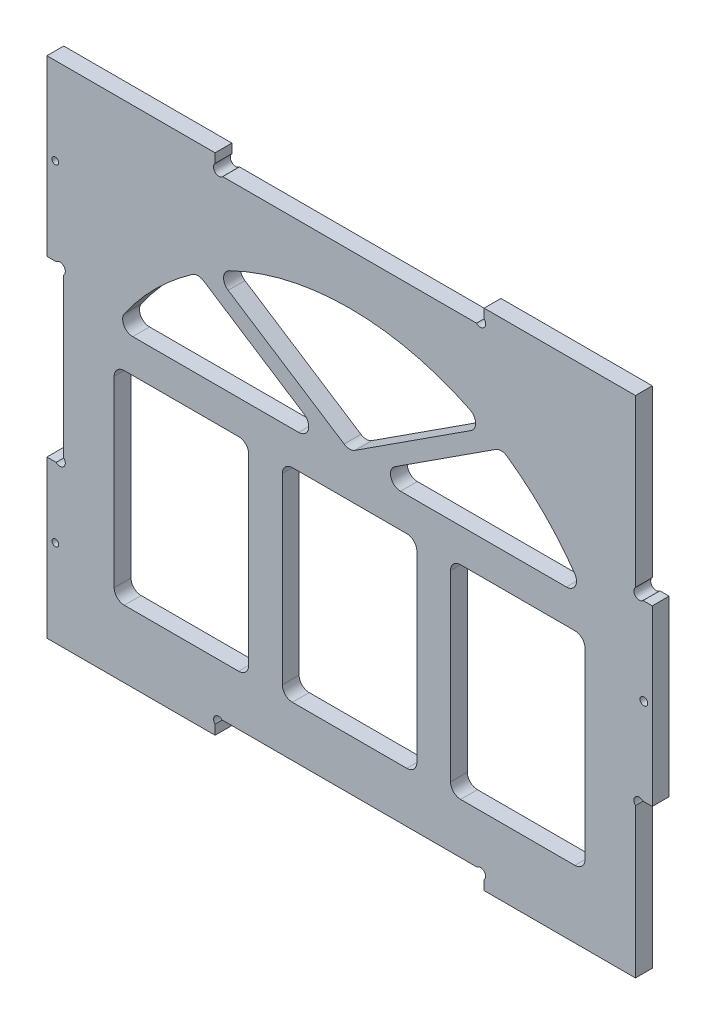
ISO-10303-21;
HEADER;
FILE_DESCRIPTION(('STEP AP214'),'2;1');
FILE_NAME('part.step','',(''),(''),'','','');
FILE_SCHEMA(('AUTOMOTIVE_DESIGN { 1 0 10303 214 1 1 1 1 }'));
ENDSEC;
DATA;
#1=APPLICATION_CONTEXT('core data for automotive mechanical design processes');
#2=APPLICATION_PROTOCOL_DEFINITION('international standard','automotive_design',2000,#1);
#3=PRODUCT_CONTEXT('',#1,'mechanical');
#4=PRODUCT('Part','Part','',(#3));
#5=PRODUCT_RELATED_PRODUCT_CATEGORY('part','',(#4));
#6=PRODUCT_DEFINITION_FORMATION('','',#4);
#7=PRODUCT_DEFINITION_CONTEXT('part definition',#1,'design');
#8=PRODUCT_DEFINITION('design','',#6,#7);
#9=PRODUCT_DEFINITION_SHAPE('','',#8);
#10=(LENGTH_UNIT() NAMED_UNIT(*) SI_UNIT(.MILLI.,.METRE.));
#11=(NAMED_UNIT(*) PLANE_ANGLE_UNIT() SI_UNIT($,.RADIAN.));
#12=(NAMED_UNIT(*) SI_UNIT($,.STERADIAN.) SOLID_ANGLE_UNIT());
#13=UNCERTAINTY_MEASURE_WITH_UNIT(LENGTH_MEASURE(1.E-05),#10,'distance_accuracy_value','');
#14=(GEOMETRIC_REPRESENTATION_CONTEXT(3) GLOBAL_UNCERTAINTY_ASSIGNED_CONTEXT((#13)) GLOBAL_UNIT_ASSIGNED_CONTEXT((#10,
#11,#12)) REPRESENTATION_CONTEXT('',''));
#15=CARTESIAN_POINT('',(0.,0.,0.));
#16=DIRECTION('',(0.,0.,1.));
#17=DIRECTION('',(1.,0.,0.));
#18=AXIS2_PLACEMENT_3D('',#15,#16,#17);
#19=CARTESIAN_POINT('',(51.0606601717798,-1.06066017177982,5.));
#20=DIRECTION('',(0.,0.,1.));
#21=DIRECTION('',(1.,0.,0.));
#22=AXIS2_PLACEMENT_3D('',#19,#20,#21);
#23=PLANE('',#22);
#24=DIRECTION('',(1.,0.,0.));
#25=VECTOR('',#24,1.);
#26=CARTESIAN_POINT('',(0.,15.,5.));
#27=LINE('',#26,#25);
#28=CARTESIAN_POINT('',(23.,15.,5.));
#29=VERTEX_POINT('',#28);
#30=CARTESIAN_POINT('',(57.,15.,5.));
#31=VERTEX_POINT('',#30);
#32=EDGE_CURVE('E1085',#29,#31,#27,.T.);
#33=ORIENTED_EDGE('',*,*,#32,.F.);
#34=CARTESIAN_POINT('',(23.,18.,5.));
#35=DIRECTION('',(0.,0.,1.));
#36=DIRECTION('',(1.,0.,0.));
#37=AXIS2_PLACEMENT_3D('',#34,#35,#36);
#38=CIRCLE('',#37,3.);
#39=CARTESIAN_POINT('',(20.,18.,5.));
#40=VERTEX_POINT('',#39);
#41=EDGE_CURVE('E916',#29,#40,#38,.F.);
#42=ORIENTED_EDGE('',*,*,#41,.T.);
#43=DIRECTION('',(0.,1.,0.));
#44=VECTOR('',#43,1.);
#45=CARTESIAN_POINT('',(20.,0.,5.));
#46=LINE('',#45,#44);
#47=CARTESIAN_POINT('',(20.,72.4218834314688,5.));
#48=VERTEX_POINT('',#47);
#49=EDGE_CURVE('E1087',#40,#48,#46,.T.);
#50=ORIENTED_EDGE('',*,*,#49,.T.);
#51=CARTESIAN_POINT('',(23.,72.4218834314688,5.));
#52=DIRECTION('',(0.,0.,1.));
#53=DIRECTION('',(1.,0.,0.));
#54=AXIS2_PLACEMENT_3D('',#51,#52,#53);
#55=CIRCLE('',#54,3.);
#56=CARTESIAN_POINT('',(23.,75.4218834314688,5.));
#57=VERTEX_POINT('',#56);
#58=EDGE_CURVE('E77',#48,#57,#55,.F.);
#59=ORIENTED_EDGE('',*,*,#58,.T.);
#60=DIRECTION('',(1.,0.,0.));
#61=VECTOR('',#60,1.);
#62=CARTESIAN_POINT('',(0.,75.4218834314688,5.));
#63=LINE('',#62,#61);
#64=CARTESIAN_POINT('',(57.,75.4218834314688,5.));
#65=VERTEX_POINT('',#64);
#66=EDGE_CURVE('E1084',#57,#65,#63,.T.);
#67=ORIENTED_EDGE('',*,*,#66,.T.);
#68=CARTESIAN_POINT('',(57.,72.4218834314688,5.));
#69=DIRECTION('',(0.,0.,1.));
#70=DIRECTION('',(1.,0.,0.));
#71=AXIS2_PLACEMENT_3D('',#68,#69,#70);
#72=CIRCLE('',#71,3.);
#73=CARTESIAN_POINT('',(60.,72.4218834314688,5.));
#74=VERTEX_POINT('',#73);
#75=EDGE_CURVE('E84',#65,#74,#72,.F.);
#76=ORIENTED_EDGE('',*,*,#75,.T.);
#77=DIRECTION('',(0.,1.,0.));
#78=VECTOR('',#77,1.);
#79=CARTESIAN_POINT('',(60.,0.,5.));
#80=LINE('',#79,#78);
#81=CARTESIAN_POINT('',(60.,18.,5.));
#82=VERTEX_POINT('',#81);
#83=EDGE_CURVE('E1083',#82,#74,#80,.T.);
#84=ORIENTED_EDGE('',*,*,#83,.F.);
#85=CARTESIAN_POINT('',(57.,18.,5.));
#86=DIRECTION('',(0.,0.,1.));
#87=DIRECTION('',(1.,0.,0.));
#88=AXIS2_PLACEMENT_3D('',#85,#86,#87);
#89=CIRCLE('',#88,3.);
#90=EDGE_CURVE('E912',#82,#31,#89,.F.);
#91=ORIENTED_EDGE('',*,*,#90,.T.);
#92=EDGE_LOOP('',(#33,#42,#50,#59,#67,#76,#84,#91));
#93=FACE_BOUND('',#92,.T.);
#94=DIRECTION('',(1.,0.,0.));
#95=VECTOR('',#94,1.);
#96=CARTESIAN_POINT('',(0.,85.4218834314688,5.));
#97=LINE('',#96,#95);
#98=CARTESIAN_POINT('',(105.147998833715,85.4218834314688,5.));
#99=VERTEX_POINT('',#98);
#100=CARTESIAN_POINT('',(154.476082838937,85.4218834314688,5.));
#101=VERTEX_POINT('',#100);
#102=EDGE_CURVE('E1123',#99,#101,#97,.T.);
#103=ORIENTED_EDGE('',*,*,#102,.F.);
#104=CARTESIAN_POINT('',(105.147998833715,88.4218834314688,5.));
#105=DIRECTION('',(0.,0.,1.));
#106=DIRECTION('',(1.,0.,0.));
#107=AXIS2_PLACEMENT_3D('',#104,#105,#106);
#108=CIRCLE('',#107,3.);
#109=CARTESIAN_POINT('',(103.516806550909,90.9396625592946,5.));
#110=VERTEX_POINT('',#109);
#111=EDGE_CURVE('E789',#99,#110,#108,.F.);
#112=ORIENTED_EDGE('',*,*,#111,.T.);
#113=DIRECTION('',(0.839259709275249,0.543730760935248,0.));
#114=VECTOR('',#113,1.);
#115=CARTESIAN_POINT('',(-10.894582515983,16.816014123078,5.));
#116=LINE('',#115,#114);
#117=CARTESIAN_POINT('',(133.444261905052,110.328747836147,5.));
#118=VERTEX_POINT('',#117);
#119=EDGE_CURVE('E1120',#110,#118,#116,.T.);
#120=ORIENTED_EDGE('',*,*,#119,.T.);
#121=CARTESIAN_POINT('',(135.075454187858,107.810968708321,5.));
#122=DIRECTION('',(0.,0.,1.));
#123=DIRECTION('',(1.,0.,0.));
#124=AXIS2_PLACEMENT_3D('',#121,#122,#123);
#125=CIRCLE('',#124,3.);
#126=CARTESIAN_POINT('',(136.793880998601,110.270035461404,5.));
#127=VERTEX_POINT('',#126);
#128=EDGE_CURVE('E793',#118,#127,#125,.F.);
#129=ORIENTED_EDGE('',*,*,#128,.T.);
#130=CARTESIAN_POINT('',(90.,43.3080465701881,5.));
#131=DIRECTION('',(0.,0.,1.));
#132=DIRECTION('',(1.,0.,0.));
#133=AXIS2_PLACEMENT_3D('',#130,#131,#132);
#134=CIRCLE('',#133,81.691953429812);
#135=CARTESIAN_POINT('',(156.934126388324,90.1417735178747,5.));
#136=VERTEX_POINT('',#135);
#137=EDGE_CURVE('E1117',#127,#136,#134,.F.);
#138=ORIENTED_EDGE('',*,*,#137,.T.);
#139=CARTESIAN_POINT('',(154.476082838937,88.4218834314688,5.));
#140=DIRECTION('',(0.,0.,1.));
#141=DIRECTION('',(1.,0.,0.));
#142=AXIS2_PLACEMENT_3D('',#139,#140,#141);
#143=CIRCLE('',#142,3.);
#144=EDGE_CURVE('E785',#136,#101,#143,.F.);
#145=ORIENTED_EDGE('',*,*,#144,.T.);
#146=EDGE_LOOP('',(#103,#112,#120,#129,#138,#145));
#147=FACE_BOUND('',#146,.T.);
#148=DIRECTION('',(1.,0.,0.));
#149=VECTOR('',#148,1.);
#150=CARTESIAN_POINT('',(0.,85.4218834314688,5.));
#151=LINE('',#150,#149);
#152=CARTESIAN_POINT('',(25.5239171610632,85.4218834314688,5.));
#153=VERTEX_POINT('',#152);
#154=CARTESIAN_POINT('',(74.8520011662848,85.4218834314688,5.));
#155=VERTEX_POINT('',#154);
#156=EDGE_CURVE('E1138',#153,#155,#151,.T.);
#157=ORIENTED_EDGE('',*,*,#156,.F.);
#158=CARTESIAN_POINT('',(25.5239171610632,88.4218834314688,5.));
#159=DIRECTION('',(0.,0.,1.));
#160=DIRECTION('',(1.,0.,0.));
#161=AXIS2_PLACEMENT_3D('',#158,#159,#160);
#162=CIRCLE('',#161,3.);
#163=CARTESIAN_POINT('',(23.0658736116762,90.1417735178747,5.));
#164=VERTEX_POINT('',#163);
#165=EDGE_CURVE('E809',#153,#164,#162,.F.);
#166=ORIENTED_EDGE('',*,*,#165,.T.);
#167=CARTESIAN_POINT('',(90.,43.3080465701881,5.));
#168=DIRECTION('',(0.,0.,1.));
#169=DIRECTION('',(1.,0.,0.));
#170=AXIS2_PLACEMENT_3D('',#167,#168,#169);
#171=CIRCLE('',#170,81.691953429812);
#172=CARTESIAN_POINT('',(43.2061190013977,110.270035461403,5.));
#173=VERTEX_POINT('',#172);
#174=EDGE_CURVE('E1135',#164,#173,#171,.F.);
#175=ORIENTED_EDGE('',*,*,#174,.T.);
#176=CARTESIAN_POINT('',(44.9245458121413,107.81096870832,5.));
#177=DIRECTION('',(0.,0.,1.));
#178=DIRECTION('',(1.,0.,0.));
#179=AXIS2_PLACEMENT_3D('',#176,#177,#178);
#180=CIRCLE('',#179,3.);
#181=CARTESIAN_POINT('',(46.555738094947,110.328747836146,5.));
#182=VERTEX_POINT('',#181);
#183=EDGE_CURVE('E813',#173,#182,#180,.F.);
#184=ORIENTED_EDGE('',*,*,#183,.T.);
#185=DIRECTION('',(-0.839259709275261,0.54373076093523,0.));
#186=VECTOR('',#185,1.);
#187=CARTESIAN_POINT('',(64.1103477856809,98.9556517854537,5.));
#188=LINE('',#187,#186);
#189=CARTESIAN_POINT('',(76.4831934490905,90.9396625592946,5.));
#190=VERTEX_POINT('',#189);
#191=EDGE_CURVE('E1141',#190,#182,#188,.T.);
#192=ORIENTED_EDGE('',*,*,#191,.F.);
#193=CARTESIAN_POINT('',(74.8520011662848,88.4218834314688,5.));
#194=DIRECTION('',(0.,0.,1.));
#195=DIRECTION('',(1.,0.,0.));
#196=AXIS2_PLACEMENT_3D('',#193,#194,#195);
#197=CIRCLE('',#196,3.);
#198=EDGE_CURVE('E817',#190,#155,#197,.F.);
#199=ORIENTED_EDGE('',*,*,#198,.T.);
#200=EDGE_LOOP('',(#157,#166,#175,#184,#192,#199));
#201=FACE_BOUND('',#200,.T.);
#202=CARTESIAN_POINT('',(2.5,119.166666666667,5.));
#203=DIRECTION('',(0.,0.,1.));
#204=DIRECTION('',(1.,0.,0.));
#205=AXIS2_PLACEMENT_3D('',#202,#203,#204);
#206=CIRCLE('',#205,1.);
#207=CARTESIAN_POINT('',(3.5,119.166666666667,5.));
#208=VERTEX_POINT('',#207);
#209=EDGE_CURVE('E677',#208,#208,#206,.T.);
#210=ORIENTED_EDGE('',*,*,#209,.F.);
#211=EDGE_LOOP('',(#210));
#212=FACE_BOUND('',#211,.T.);
#213=CARTESIAN_POINT('',(2.5,20.8333333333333,5.));
#214=DIRECTION('',(0.,0.,1.));
#215=DIRECTION('',(1.,0.,0.));
#216=AXIS2_PLACEMENT_3D('',#213,#214,#215);
#217=CIRCLE('',#216,1.);
#218=CARTESIAN_POINT('',(3.50000000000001,20.8333333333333,5.));
#219=VERTEX_POINT('',#218);
#220=EDGE_CURVE('E673',#219,#219,#217,.T.);
#221=ORIENTED_EDGE('',*,*,#220,.F.);
#222=EDGE_LOOP('',(#221));
#223=FACE_BOUND('',#222,.T.);
#224=CARTESIAN_POINT('',(177.5,67.5,5.));
#225=DIRECTION('',(0.,0.,1.));
#226=DIRECTION('',(1.,0.,0.));
#227=AXIS2_PLACEMENT_3D('',#224,#225,#226);
#228=CIRCLE('',#227,1.15000000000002);
#229=CARTESIAN_POINT('',(178.65,67.5,5.));
#230=VERTEX_POINT('',#229);
#231=EDGE_CURVE('E672',#230,#230,#228,.T.);
#232=ORIENTED_EDGE('',*,*,#231,.F.);
#233=EDGE_LOOP('',(#232));
#234=FACE_BOUND('',#233,.T.);
#235=CARTESIAN_POINT('',(176.131370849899,40.5352958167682,5.));
#236=DIRECTION('',(0.,0.,1.));
#237=DIRECTION('',(1.,0.,0.));
#238=AXIS2_PLACEMENT_3D('',#235,#236,#237);
#239=CIRCLE('',#238,1.59999999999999);
#240=CARTESIAN_POINT('',(177.262741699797,41.6666666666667,5.));
#241=VERTEX_POINT('',#240);
#242=CARTESIAN_POINT('',(175.,39.4039249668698,5.));
#243=VERTEX_POINT('',#242);
#244=EDGE_CURVE('E506',#241,#243,#239,.T.);
#245=ORIENTED_EDGE('',*,*,#244,.F.);
#246=DIRECTION('',(-1.,0.,0.));
#247=VECTOR('',#246,1.);
#248=CARTESIAN_POINT('',(180.,41.6666666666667,5.));
#249=LINE('',#248,#247);
#250=CARTESIAN_POINT('',(180.,41.6666666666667,5.));
#251=VERTEX_POINT('',#250);
#252=EDGE_CURVE('E511',#251,#241,#249,.T.);
#253=ORIENTED_EDGE('',*,*,#252,.F.);
#254=DIRECTION('',(0.,1.,0.));
#255=VECTOR('',#254,1.);
#256=CARTESIAN_POINT('',(180.,0.,5.));
#257=LINE('',#256,#255);
#258=CARTESIAN_POINT('',(180.,93.3333333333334,5.));
#259=VERTEX_POINT('',#258);
#260=EDGE_CURVE('E595',#251,#259,#257,.T.);
#261=ORIENTED_EDGE('',*,*,#260,.T.);
#262=DIRECTION('',(1.,0.,0.));
#263=VECTOR('',#262,1.);
#264=CARTESIAN_POINT('',(175.,93.3333333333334,5.));
#265=LINE('',#264,#263);
#266=CARTESIAN_POINT('',(177.262741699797,93.3333333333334,5.));
#267=VERTEX_POINT('',#266);
#268=EDGE_CURVE('E546',#267,#259,#265,.T.);
#269=ORIENTED_EDGE('',*,*,#268,.F.);
#270=CARTESIAN_POINT('',(176.131370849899,94.4647041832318,5.));
#271=DIRECTION('',(0.,0.,1.));
#272=DIRECTION('',(1.,0.,0.));
#273=AXIS2_PLACEMENT_3D('',#270,#271,#272);
#274=CIRCLE('',#273,1.59999999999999);
#275=CARTESIAN_POINT('',(175.,95.5960750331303,5.));
#276=VERTEX_POINT('',#275);
#277=EDGE_CURVE('E1155',#276,#267,#274,.T.);
#278=ORIENTED_EDGE('',*,*,#277,.F.);
#279=DIRECTION('',(0.,-1.,0.));
#280=VECTOR('',#279,1.);
#281=CARTESIAN_POINT('',(175.,145.,5.));
#282=LINE('',#281,#280);
#283=CARTESIAN_POINT('',(175.,145.,5.));
#284=VERTEX_POINT('',#283);
#285=EDGE_CURVE('E541',#284,#276,#282,.T.);
#286=ORIENTED_EDGE('',*,*,#285,.F.);
#287=DIRECTION('',(-1.,0.,0.));
#288=VECTOR('',#287,1.);
#289=CARTESIAN_POINT('',(0.,145.,5.));
#290=LINE('',#289,#288);
#291=CARTESIAN_POINT('',(130.,145.,5.));
#292=VERTEX_POINT('',#291);
#293=EDGE_CURVE('E598',#284,#292,#290,.T.);
#294=ORIENTED_EDGE('',*,*,#293,.T.);
#295=DIRECTION('',(0.,1.,0.));
#296=VECTOR('',#295,1.);
#297=CARTESIAN_POINT('',(130.,145.,5.));
#298=LINE('',#297,#296);
#299=CARTESIAN_POINT('',(130.,142.262741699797,5.));
#300=VERTEX_POINT('',#299);
#301=EDGE_CURVE('E1198',#300,#292,#298,.T.);
#302=ORIENTED_EDGE('',*,*,#301,.F.);
#303=CARTESIAN_POINT('',(128.868629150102,141.131370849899,5.));
#304=DIRECTION('',(0.,0.,1.));
#305=DIRECTION('',(1.,0.,0.));
#306=AXIS2_PLACEMENT_3D('',#303,#304,#305);
#307=CIRCLE('',#306,1.59999999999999);
#308=CARTESIAN_POINT('',(127.737258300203,140.,5.));
#309=VERTEX_POINT('',#308);
#310=EDGE_CURVE('E1178',#309,#300,#307,.T.);
#311=ORIENTED_EDGE('',*,*,#310,.F.);
#312=DIRECTION('',(1.,0.,0.));
#313=VECTOR('',#312,1.);
#314=CARTESIAN_POINT('',(50.,140.,5.));
#315=LINE('',#314,#313);
#316=CARTESIAN_POINT('',(52.2627416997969,140.,5.));
#317=VERTEX_POINT('',#316);
#318=EDGE_CURVE('E1205',#317,#309,#315,.T.);
#319=ORIENTED_EDGE('',*,*,#318,.F.);
#320=CARTESIAN_POINT('',(51.1313708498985,141.131370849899,5.));
#321=DIRECTION('',(0.,0.,1.));
#322=DIRECTION('',(1.,0.,0.));
#323=AXIS2_PLACEMENT_3D('',#320,#321,#322);
#324=CIRCLE('',#323,1.6);
#325=CARTESIAN_POINT('',(50.,142.262741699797,5.));
#326=VERTEX_POINT('',#325);
#327=EDGE_CURVE('E1186',#326,#317,#324,.T.);
#328=ORIENTED_EDGE('',*,*,#327,.F.);
#329=DIRECTION('',(0.,-1.,0.));
#330=VECTOR('',#329,1.);
#331=CARTESIAN_POINT('',(50.,145.,5.));
#332=LINE('',#331,#330);
#333=CARTESIAN_POINT('',(50.,145.,5.));
#334=VERTEX_POINT('',#333);
#335=EDGE_CURVE('E1193',#334,#326,#332,.T.);
#336=ORIENTED_EDGE('',*,*,#335,.F.);
#337=CARTESIAN_POINT('',(0.,145.,5.));
#338=VERTEX_POINT('',#337);
#339=EDGE_CURVE('E597',#334,#338,#290,.T.);
#340=ORIENTED_EDGE('',*,*,#339,.T.);
#341=DIRECTION('',(0.,-1.,0.));
#342=VECTOR('',#341,1.);
#343=CARTESIAN_POINT('',(0.,0.,5.));
#344=LINE('',#343,#342);
#345=CARTESIAN_POINT('',(0.,93.3333333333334,5.));
#346=VERTEX_POINT('',#345);
#347=EDGE_CURVE('E576',#338,#346,#344,.T.);
#348=ORIENTED_EDGE('',*,*,#347,.T.);
#349=DIRECTION('',(-1.,0.,0.));
#350=VECTOR('',#349,1.);
#351=CARTESIAN_POINT('',(0.,93.3333333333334,5.));
#352=LINE('',#351,#350);
#353=CARTESIAN_POINT('',(2.73725830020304,93.3333333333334,5.));
#354=VERTEX_POINT('',#353);
#355=EDGE_CURVE('E561',#354,#346,#352,.T.);
#356=ORIENTED_EDGE('',*,*,#355,.F.);
#357=CARTESIAN_POINT('',(3.86862915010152,92.2019624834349,5.));
#358=DIRECTION('',(0.,0.,1.));
#359=DIRECTION('',(1.,0.,0.));
#360=AXIS2_PLACEMENT_3D('',#357,#358,#359);
#361=CIRCLE('',#360,1.6);
#362=CARTESIAN_POINT('',(5.,91.0705916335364,5.));
#363=VERTEX_POINT('',#362);
#364=EDGE_CURVE('E1170',#363,#354,#361,.T.);
#365=ORIENTED_EDGE('',*,*,#364,.F.);
#366=DIRECTION('',(0.,1.,0.));
#367=VECTOR('',#366,1.);
#368=CARTESIAN_POINT('',(5.,93.3333333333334,5.));
#369=LINE('',#368,#367);
#370=CARTESIAN_POINT('',(5.00000000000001,43.9294083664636,5.));
#371=VERTEX_POINT('',#370);
#372=EDGE_CURVE('E568',#371,#363,#369,.T.);
#373=ORIENTED_EDGE('',*,*,#372,.F.);
#374=CARTESIAN_POINT('',(3.86862915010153,42.7980375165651,5.));
#375=DIRECTION('',(0.,0.,1.));
#376=DIRECTION('',(1.,0.,0.));
#377=AXIS2_PLACEMENT_3D('',#374,#375,#376);
#378=CIRCLE('',#377,1.60000000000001);
#379=CARTESIAN_POINT('',(2.73725830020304,41.6666666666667,5.));
#380=VERTEX_POINT('',#379);
#381=EDGE_CURVE('E1162',#380,#371,#378,.T.);
#382=ORIENTED_EDGE('',*,*,#381,.F.);
#383=DIRECTION('',(1.,0.,0.));
#384=VECTOR('',#383,1.);
#385=CARTESIAN_POINT('',(0.,41.6666666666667,5.));
#386=LINE('',#385,#384);
#387=CARTESIAN_POINT('',(0.,41.6666666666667,5.));
#388=VERTEX_POINT('',#387);
#389=EDGE_CURVE('E554',#388,#380,#386,.T.);
#390=ORIENTED_EDGE('',*,*,#389,.F.);
#391=CARTESIAN_POINT('',(0.,-5.,5.));
#392=VERTEX_POINT('',#391);
#393=EDGE_CURVE('E580',#388,#392,#344,.T.);
#394=ORIENTED_EDGE('',*,*,#393,.T.);
#395=DIRECTION('',(1.,0.,0.));
#396=VECTOR('',#395,1.);
#397=CARTESIAN_POINT('',(0.,-5.,5.));
#398=LINE('',#397,#396);
#399=CARTESIAN_POINT('',(50.,-5.00000000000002,5.));
#400=VERTEX_POINT('',#399);
#401=EDGE_CURVE('E579',#392,#400,#398,.T.);
#402=ORIENTED_EDGE('',*,*,#401,.T.);
#403=DIRECTION('',(0.,1.,0.));
#404=VECTOR('',#403,1.);
#405=CARTESIAN_POINT('',(50.,-5.00000000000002,5.));
#406=LINE('',#405,#404);
#407=CARTESIAN_POINT('',(50.,-2.12132034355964,5.));
#408=VERTEX_POINT('',#407);
#409=EDGE_CURVE('E582',#400,#408,#406,.T.);
#410=ORIENTED_EDGE('',*,*,#409,.T.);
#411=CARTESIAN_POINT('',(51.0606601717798,-1.06066017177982,5.));
#412=DIRECTION('',(0.,0.,-1.));
#413=DIRECTION('',(1.,0.,0.));
#414=AXIS2_PLACEMENT_3D('',#411,#412,#413);
#415=CIRCLE('',#414,1.5);
#416=CARTESIAN_POINT('',(52.1213203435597,0.,5.));
#417=VERTEX_POINT('',#416);
#418=EDGE_CURVE('E584',#408,#417,#415,.T.);
#419=ORIENTED_EDGE('',*,*,#418,.T.);
#420=DIRECTION('',(1.,0.,0.));
#421=VECTOR('',#420,1.);
#422=CARTESIAN_POINT('',(52.1213203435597,0.,5.));
#423=LINE('',#422,#421);
#424=CARTESIAN_POINT('',(127.87867965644,0.,5.));
#425=VERTEX_POINT('',#424);
#426=EDGE_CURVE('E586',#417,#425,#423,.T.);
#427=ORIENTED_EDGE('',*,*,#426,.T.);
#428=CARTESIAN_POINT('',(128.93933982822,-1.06066017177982,5.));
#429=DIRECTION('',(0.,0.,-1.));
#430=DIRECTION('',(1.,0.,0.));
#431=AXIS2_PLACEMENT_3D('',#428,#429,#430);
#432=CIRCLE('',#431,1.49999999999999);
#433=CARTESIAN_POINT('',(130.,-2.12132034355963,5.));
#434=VERTEX_POINT('',#433);
#435=EDGE_CURVE('E588',#425,#434,#432,.T.);
#436=ORIENTED_EDGE('',*,*,#435,.T.);
#437=DIRECTION('',(0.,-1.,0.));
#438=VECTOR('',#437,1.);
#439=CARTESIAN_POINT('',(130.,-5.00000000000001,5.));
#440=LINE('',#439,#438);
#441=CARTESIAN_POINT('',(130.,-5.00000000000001,5.));
#442=VERTEX_POINT('',#441);
#443=EDGE_CURVE('E590',#434,#442,#440,.T.);
#444=ORIENTED_EDGE('',*,*,#443,.T.);
#445=DIRECTION('',(1.,0.,0.));
#446=VECTOR('',#445,1.);
#447=CARTESIAN_POINT('',(175.,-4.99999999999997,5.));
#448=LINE('',#447,#446);
#449=CARTESIAN_POINT('',(175.,-4.99999999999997,5.));
#450=VERTEX_POINT('',#449);
#451=EDGE_CURVE('E592',#442,#450,#448,.T.);
#452=ORIENTED_EDGE('',*,*,#451,.T.);
#453=DIRECTION('',(0.,1.,0.));
#454=VECTOR('',#453,1.);
#455=CARTESIAN_POINT('',(175.,-4.99999999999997,5.));
#456=LINE('',#455,#454);
#457=EDGE_CURVE('E514',#450,#243,#456,.T.);
#458=ORIENTED_EDGE('',*,*,#457,.T.);
#459=EDGE_LOOP('',(#245,#253,#261,#269,#278,#286,#294,#302,#311,#319,#328,#336,#340,#348,#356,
#365,#373,#382,#390,#394,#402,#410,#419,#427,#436,#444,#452,#458));
#460=FACE_BOUND('',#459,.T.);
#461=DIRECTION('',(0.839259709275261,-0.54373076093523,0.));
#462=VECTOR('',#461,1.);
#463=CARTESIAN_POINT('',(66.829001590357,103.15195033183,5.));
#464=LINE('',#463,#462);
#465=CARTESIAN_POINT('',(53.8971245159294,111.530118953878,5.));
#466=VERTEX_POINT('',#465);
#467=CARTESIAN_POINT('',(88.3688077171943,89.196967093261,5.));
#468=VERTEX_POINT('',#467);
#469=EDGE_CURVE('E1129',#466,#468,#464,.T.);
#470=ORIENTED_EDGE('',*,*,#469,.F.);
#471=CARTESIAN_POINT('',(55.5283167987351,114.047898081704,5.));
#472=DIRECTION('',(0.,0.,1.));
#473=DIRECTION('',(1.,0.,0.));
#474=AXIS2_PLACEMENT_3D('',#471,#472,#473);
#475=CIRCLE('',#474,3.);
#476=CARTESIAN_POINT('',(54.2141411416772,116.744737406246,5.));
#477=VERTEX_POINT('',#476);
#478=EDGE_CURVE('E805',#466,#477,#475,.F.);
#479=ORIENTED_EDGE('',*,*,#478,.T.);
#480=CARTESIAN_POINT('',(90.,43.3080465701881,5.));
#481=DIRECTION('',(0.,0.,1.));
#482=DIRECTION('',(1.,0.,0.));
#483=AXIS2_PLACEMENT_3D('',#480,#481,#482);
#484=CIRCLE('',#483,81.691953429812);
#485=CARTESIAN_POINT('',(125.785858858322,116.744737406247,5.));
#486=VERTEX_POINT('',#485);
#487=EDGE_CURVE('E1126',#477,#486,#484,.F.);
#488=ORIENTED_EDGE('',*,*,#487,.T.);
#489=CARTESIAN_POINT('',(124.471683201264,114.047898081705,5.));
#490=DIRECTION('',(0.,0.,1.));
#491=DIRECTION('',(1.,0.,0.));
#492=AXIS2_PLACEMENT_3D('',#489,#490,#491);
#493=CIRCLE('',#492,3.);
#494=CARTESIAN_POINT('',(126.10287548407,111.530118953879,5.));
#495=VERTEX_POINT('',#494);
#496=EDGE_CURVE('E797',#486,#495,#493,.F.);
#497=ORIENTED_EDGE('',*,*,#496,.T.);
#498=DIRECTION('',(0.83925970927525,0.543730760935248,0.));
#499=VECTOR('',#498,1.);
#500=CARTESIAN_POINT('',(-13.6132363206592,21.0123126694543,5.));
#501=LINE('',#500,#499);
#502=CARTESIAN_POINT('',(91.6311922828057,89.196967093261,5.));
#503=VERTEX_POINT('',#502);
#504=EDGE_CURVE('E1132',#503,#495,#501,.T.);
#505=ORIENTED_EDGE('',*,*,#504,.F.);
#506=CARTESIAN_POINT('',(90.,91.7147462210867,5.));
#507=DIRECTION('',(0.,0.,1.));
#508=DIRECTION('',(1.,0.,0.));
#509=AXIS2_PLACEMENT_3D('',#506,#507,#508);
#510=CIRCLE('',#509,3.);
#511=EDGE_CURVE('E801',#503,#468,#510,.F.);
#512=ORIENTED_EDGE('',*,*,#511,.T.);
#513=EDGE_LOOP('',(#470,#479,#488,#497,#505,#512));
#514=FACE_BOUND('',#513,.T.);
#515=DIRECTION('',(1.,0.,0.));
#516=VECTOR('',#515,1.);
#517=CARTESIAN_POINT('',(0.,15.,5.));
#518=LINE('',#517,#516);
#519=CARTESIAN_POINT('',(123.,15.,5.));
#520=VERTEX_POINT('',#519);
#521=CARTESIAN_POINT('',(157.,15.,5.));
#522=VERTEX_POINT('',#521);
#523=EDGE_CURVE('E1105',#520,#522,#518,.T.);
#524=ORIENTED_EDGE('',*,*,#523,.F.);
#525=CARTESIAN_POINT('',(123.,18.,5.));
#526=DIRECTION('',(0.,0.,1.));
#527=DIRECTION('',(1.,0.,0.));
#528=AXIS2_PLACEMENT_3D('',#525,#526,#527);
#529=CIRCLE('',#528,3.);
#530=CARTESIAN_POINT('',(120.,18.,5.));
#531=VERTEX_POINT('',#530);
#532=EDGE_CURVE('E888',#520,#531,#529,.F.);
#533=ORIENTED_EDGE('',*,*,#532,.T.);
#534=DIRECTION('',(0.,1.,0.));
#535=VECTOR('',#534,1.);
#536=CARTESIAN_POINT('',(120.,0.,5.));
#537=LINE('',#536,#535);
#538=CARTESIAN_POINT('',(120.,72.4218834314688,5.));
#539=VERTEX_POINT('',#538);
#540=EDGE_CURVE('E1114',#531,#539,#537,.T.);
#541=ORIENTED_EDGE('',*,*,#540,.T.);
#542=CARTESIAN_POINT('',(123.,72.4218834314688,5.));
#543=DIRECTION('',(0.,0.,1.));
#544=DIRECTION('',(1.,0.,0.));
#545=AXIS2_PLACEMENT_3D('',#542,#543,#544);
#546=CIRCLE('',#545,3.);
#547=CARTESIAN_POINT('',(123.,75.4218834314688,5.));
#548=VERTEX_POINT('',#547);
#549=EDGE_CURVE('E892',#539,#548,#546,.F.);
#550=ORIENTED_EDGE('',*,*,#549,.T.);
#551=DIRECTION('',(1.,0.,0.));
#552=VECTOR('',#551,1.);
#553=CARTESIAN_POINT('',(0.,75.4218834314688,5.));
#554=LINE('',#553,#552);
#555=CARTESIAN_POINT('',(157.,75.4218834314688,5.));
#556=VERTEX_POINT('',#555);
#557=EDGE_CURVE('E1111',#548,#556,#554,.T.);
#558=ORIENTED_EDGE('',*,*,#557,.T.);
#559=CARTESIAN_POINT('',(157.,72.4218834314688,5.));
#560=DIRECTION('',(0.,0.,1.));
#561=DIRECTION('',(1.,0.,0.));
#562=AXIS2_PLACEMENT_3D('',#559,#560,#561);
#563=CIRCLE('',#562,3.);
#564=CARTESIAN_POINT('',(160.,72.4218834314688,5.));
#565=VERTEX_POINT('',#564);
#566=EDGE_CURVE('E880',#556,#565,#563,.F.);
#567=ORIENTED_EDGE('',*,*,#566,.T.);
#568=DIRECTION('',(0.,1.,0.));
#569=VECTOR('',#568,1.);
#570=CARTESIAN_POINT('',(160.,0.,5.));
#571=LINE('',#570,#569);
#572=CARTESIAN_POINT('',(160.,18.,5.));
#573=VERTEX_POINT('',#572);
#574=EDGE_CURVE('E1108',#573,#565,#571,.T.);
#575=ORIENTED_EDGE('',*,*,#574,.F.);
#576=CARTESIAN_POINT('',(157.,18.,5.));
#577=DIRECTION('',(0.,0.,1.));
#578=DIRECTION('',(1.,0.,0.));
#579=AXIS2_PLACEMENT_3D('',#576,#577,#578);
#580=CIRCLE('',#579,3.);
#581=EDGE_CURVE('E884',#573,#522,#580,.F.);
#582=ORIENTED_EDGE('',*,*,#581,.T.);
#583=EDGE_LOOP('',(#524,#533,#541,#550,#558,#567,#575,#582));
#584=FACE_BOUND('',#583,.T.);
#585=DIRECTION('',(0.,-1.,0.));
#586=VECTOR('',#585,1.);
#587=CARTESIAN_POINT('',(70.,0.,5.));
#588=LINE('',#587,#586);
#589=CARTESIAN_POINT('',(70.,72.4218834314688,5.));
#590=VERTEX_POINT('',#589);
#591=CARTESIAN_POINT('',(70.,18.,5.));
#592=VERTEX_POINT('',#591);
#593=EDGE_CURVE('E1099',#590,#592,#588,.T.);
#594=ORIENTED_EDGE('',*,*,#593,.F.);
#595=CARTESIAN_POINT('',(73.,72.4218834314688,5.));
#596=DIRECTION('',(0.,0.,1.));
#597=DIRECTION('',(1.,0.,0.));
#598=AXIS2_PLACEMENT_3D('',#595,#596,#597);
#599=CIRCLE('',#598,3.);
#600=CARTESIAN_POINT('',(73.,75.4218834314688,5.));
#601=VERTEX_POINT('',#600);
#602=EDGE_CURVE('E908',#590,#601,#599,.F.);
#603=ORIENTED_EDGE('',*,*,#602,.T.);
#604=DIRECTION('',(1.,0.,0.));
#605=VECTOR('',#604,1.);
#606=CARTESIAN_POINT('',(0.,75.4218834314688,5.));
#607=LINE('',#606,#605);
#608=CARTESIAN_POINT('',(107.,75.4218834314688,5.));
#609=VERTEX_POINT('',#608);
#610=EDGE_CURVE('E1096',#601,#609,#607,.T.);
#611=ORIENTED_EDGE('',*,*,#610,.T.);
#612=CARTESIAN_POINT('',(107.,72.4218834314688,5.));
#613=DIRECTION('',(0.,0.,1.));
#614=DIRECTION('',(1.,0.,0.));
#615=AXIS2_PLACEMENT_3D('',#612,#613,#614);
#616=CIRCLE('',#615,3.);
#617=CARTESIAN_POINT('',(110.,72.4218834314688,5.));
#618=VERTEX_POINT('',#617);
#619=EDGE_CURVE('E896',#609,#618,#616,.F.);
#620=ORIENTED_EDGE('',*,*,#619,.T.);
#621=DIRECTION('',(0.,-1.,0.));
#622=VECTOR('',#621,1.);
#623=CARTESIAN_POINT('',(110.,0.,5.));
#624=LINE('',#623,#622);
#625=CARTESIAN_POINT('',(110.,18.,5.));
#626=VERTEX_POINT('',#625);
#627=EDGE_CURVE('E1093',#618,#626,#624,.T.);
#628=ORIENTED_EDGE('',*,*,#627,.T.);
#629=CARTESIAN_POINT('',(107.,18.,5.));
#630=DIRECTION('',(0.,0.,1.));
#631=DIRECTION('',(1.,0.,0.));
#632=AXIS2_PLACEMENT_3D('',#629,#630,#631);
#633=CIRCLE('',#632,3.);
#634=CARTESIAN_POINT('',(107.,15.,5.));
#635=VERTEX_POINT('',#634);
#636=EDGE_CURVE('E900',#626,#635,#633,.F.);
#637=ORIENTED_EDGE('',*,*,#636,.T.);
#638=DIRECTION('',(1.,0.,0.));
#639=VECTOR('',#638,1.);
#640=CARTESIAN_POINT('',(0.,15.,5.));
#641=LINE('',#640,#639);
#642=CARTESIAN_POINT('',(73.,15.,5.));
#643=VERTEX_POINT('',#642);
#644=EDGE_CURVE('E1102',#643,#635,#641,.T.);
#645=ORIENTED_EDGE('',*,*,#644,.F.);
#646=CARTESIAN_POINT('',(73.,18.,5.));
#647=DIRECTION('',(0.,0.,1.));
#648=DIRECTION('',(1.,0.,0.));
#649=AXIS2_PLACEMENT_3D('',#646,#647,#648);
#650=CIRCLE('',#649,3.);
#651=EDGE_CURVE('E904',#643,#592,#650,.F.);
#652=ORIENTED_EDGE('',*,*,#651,.T.);
#653=EDGE_LOOP('',(#594,#603,#611,#620,#628,#637,#645,#652));
#654=FACE_BOUND('',#653,.T.);
#655=ADVANCED_FACE('F69',(#93,#147,#201,#212,#223,#234,#460,#514,#584,#654),#23,.T.);
#656=CARTESIAN_POINT('',(51.0606601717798,-1.06066017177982,0.));
#657=DIRECTION('',(0.,0.,1.));
#658=DIRECTION('',(1.,0.,0.));
#659=AXIS2_PLACEMENT_3D('',#656,#657,#658);
#660=PLANE('',#659);
#661=DIRECTION('',(0.,1.,0.));
#662=VECTOR('',#661,1.);
#663=CARTESIAN_POINT('',(20.,-1.06066017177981,0.));
#664=LINE('',#663,#662);
#665=CARTESIAN_POINT('',(20.,18.,0.));
#666=VERTEX_POINT('',#665);
#667=CARTESIAN_POINT('',(20.,72.4218834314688,0.));
#668=VERTEX_POINT('',#667);
#669=EDGE_CURVE('E734',#666,#668,#664,.T.);
#670=ORIENTED_EDGE('',*,*,#669,.F.);
#671=CARTESIAN_POINT('',(23.,18.,0.));
#672=DIRECTION('',(0.,0.,1.));
#673=DIRECTION('',(1.,0.,0.));
#674=AXIS2_PLACEMENT_3D('',#671,#672,#673);
#675=CIRCLE('',#674,3.);
#676=CARTESIAN_POINT('',(23.,15.,0.));
#677=VERTEX_POINT('',#676);
#678=EDGE_CURVE('E918',#666,#677,#675,.T.);
#679=ORIENTED_EDGE('',*,*,#678,.T.);
#680=DIRECTION('',(1.,0.,0.));
#681=VECTOR('',#680,1.);
#682=CARTESIAN_POINT('',(51.0606601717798,15.,0.));
#683=LINE('',#682,#681);
#684=CARTESIAN_POINT('',(57.,15.,0.));
#685=VERTEX_POINT('',#684);
#686=EDGE_CURVE('E737',#677,#685,#683,.T.);
#687=ORIENTED_EDGE('',*,*,#686,.T.);
#688=CARTESIAN_POINT('',(57.,18.,0.));
#689=DIRECTION('',(0.,0.,1.));
#690=DIRECTION('',(1.,0.,0.));
#691=AXIS2_PLACEMENT_3D('',#688,#689,#690);
#692=CIRCLE('',#691,3.);
#693=CARTESIAN_POINT('',(60.,18.,0.));
#694=VERTEX_POINT('',#693);
#695=EDGE_CURVE('E914',#685,#694,#692,.T.);
#696=ORIENTED_EDGE('',*,*,#695,.T.);
#697=DIRECTION('',(0.,1.,0.));
#698=VECTOR('',#697,1.);
#699=CARTESIAN_POINT('',(60.,-1.06066017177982,0.));
#700=LINE('',#699,#698);
#701=CARTESIAN_POINT('',(60.,72.4218834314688,0.));
#702=VERTEX_POINT('',#701);
#703=EDGE_CURVE('E728',#694,#702,#700,.T.);
#704=ORIENTED_EDGE('',*,*,#703,.T.);
#705=CARTESIAN_POINT('',(57.,72.4218834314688,0.));
#706=DIRECTION('',(0.,0.,1.));
#707=DIRECTION('',(1.,0.,0.));
#708=AXIS2_PLACEMENT_3D('',#705,#706,#707);
#709=CIRCLE('',#708,3.);
#710=CARTESIAN_POINT('',(57.,75.4218834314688,0.));
#711=VERTEX_POINT('',#710);
#712=EDGE_CURVE('E921',#702,#711,#709,.T.);
#713=ORIENTED_EDGE('',*,*,#712,.T.);
#714=DIRECTION('',(1.,0.,0.));
#715=VECTOR('',#714,1.);
#716=CARTESIAN_POINT('',(51.0606601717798,75.4218834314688,0.));
#717=LINE('',#716,#715);
#718=CARTESIAN_POINT('',(23.,75.4218834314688,0.));
#719=VERTEX_POINT('',#718);
#720=EDGE_CURVE('E731',#719,#711,#717,.T.);
#721=ORIENTED_EDGE('',*,*,#720,.F.);
#722=CARTESIAN_POINT('',(23.,72.4218834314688,0.));
#723=DIRECTION('',(0.,0.,1.));
#724=DIRECTION('',(1.,0.,0.));
#725=AXIS2_PLACEMENT_3D('',#722,#723,#724);
#726=CIRCLE('',#725,3.);
#727=EDGE_CURVE('E12',#719,#668,#726,.T.);
#728=ORIENTED_EDGE('',*,*,#727,.T.);
#729=EDGE_LOOP('',(#670,#679,#687,#696,#704,#713,#721,#728));
#730=FACE_BOUND('',#729,.T.);
#731=CARTESIAN_POINT('',(90.,43.3080465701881,0.));
#732=DIRECTION('',(0.,0.,1.));
#733=DIRECTION('',(1.,0.,0.));
#734=AXIS2_PLACEMENT_3D('',#731,#732,#733);
#735=CIRCLE('',#734,81.691953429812);
#736=CARTESIAN_POINT('',(136.793880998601,110.270035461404,0.));
#737=VERTEX_POINT('',#736);
#738=CARTESIAN_POINT('',(156.934126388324,90.1417735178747,0.));
#739=VERTEX_POINT('',#738);
#740=EDGE_CURVE('E701',#737,#739,#735,.F.);
#741=ORIENTED_EDGE('',*,*,#740,.F.);
#742=CARTESIAN_POINT('',(135.075454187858,107.810968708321,0.));
#743=DIRECTION('',(0.,0.,1.));
#744=DIRECTION('',(1.,0.,0.));
#745=AXIS2_PLACEMENT_3D('',#742,#743,#744);
#746=CIRCLE('',#745,3.);
#747=CARTESIAN_POINT('',(133.444261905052,110.328747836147,0.));
#748=VERTEX_POINT('',#747);
#749=EDGE_CURVE('E795',#737,#748,#746,.T.);
#750=ORIENTED_EDGE('',*,*,#749,.T.);
#751=DIRECTION('',(0.83925970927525,0.543730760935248,0.));
#752=VECTOR('',#751,1.);
#753=CARTESIAN_POINT('',(24.5863312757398,39.803015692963,0.));
#754=LINE('',#753,#752);
#755=CARTESIAN_POINT('',(103.516806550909,90.9396625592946,0.));
#756=VERTEX_POINT('',#755);
#757=EDGE_CURVE('E695',#756,#748,#754,.T.);
#758=ORIENTED_EDGE('',*,*,#757,.F.);
#759=CARTESIAN_POINT('',(105.147998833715,88.4218834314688,0.));
#760=DIRECTION('',(0.,0.,1.));
#761=DIRECTION('',(1.,0.,0.));
#762=AXIS2_PLACEMENT_3D('',#759,#760,#761);
#763=CIRCLE('',#762,3.);
#764=CARTESIAN_POINT('',(105.147998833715,85.4218834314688,0.));
#765=VERTEX_POINT('',#764);
#766=EDGE_CURVE('E791',#756,#765,#763,.T.);
#767=ORIENTED_EDGE('',*,*,#766,.T.);
#768=DIRECTION('',(1.,0.,0.));
#769=VECTOR('',#768,1.);
#770=CARTESIAN_POINT('',(51.0606601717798,85.4218834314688,0.));
#771=LINE('',#770,#769);
#772=CARTESIAN_POINT('',(154.476082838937,85.4218834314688,0.));
#773=VERTEX_POINT('',#772);
#774=EDGE_CURVE('E698',#765,#773,#771,.T.);
#775=ORIENTED_EDGE('',*,*,#774,.T.);
#776=CARTESIAN_POINT('',(154.476082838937,88.4218834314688,0.));
#777=DIRECTION('',(0.,0.,1.));
#778=DIRECTION('',(1.,0.,0.));
#779=AXIS2_PLACEMENT_3D('',#776,#777,#778);
#780=CIRCLE('',#779,3.);
#781=EDGE_CURVE('E787',#773,#739,#780,.T.);
#782=ORIENTED_EDGE('',*,*,#781,.T.);
#783=EDGE_LOOP('',(#741,#750,#758,#767,#775,#782));
#784=FACE_BOUND('',#783,.T.);
#785=CARTESIAN_POINT('',(90.,43.3080465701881,0.));
#786=DIRECTION('',(0.,0.,1.));
#787=DIRECTION('',(1.,0.,0.));
#788=AXIS2_PLACEMENT_3D('',#785,#786,#787);
#789=CIRCLE('',#788,81.691953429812);
#790=CARTESIAN_POINT('',(23.0658736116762,90.1417735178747,0.));
#791=VERTEX_POINT('',#790);
#792=CARTESIAN_POINT('',(43.2061190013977,110.270035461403,0.));
#793=VERTEX_POINT('',#792);
#794=EDGE_CURVE('E683',#791,#793,#789,.F.);
#795=ORIENTED_EDGE('',*,*,#794,.F.);
#796=CARTESIAN_POINT('',(25.5239171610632,88.4218834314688,0.));
#797=DIRECTION('',(0.,0.,1.));
#798=DIRECTION('',(1.,0.,0.));
#799=AXIS2_PLACEMENT_3D('',#796,#797,#798);
#800=CIRCLE('',#799,3.);
#801=CARTESIAN_POINT('',(25.5239171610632,85.4218834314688,0.));
#802=VERTEX_POINT('',#801);
#803=EDGE_CURVE('E811',#791,#802,#800,.T.);
#804=ORIENTED_EDGE('',*,*,#803,.T.);
#805=DIRECTION('',(1.,0.,0.));
#806=VECTOR('',#805,1.);
#807=CARTESIAN_POINT('',(51.0606601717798,85.4218834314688,0.));
#808=LINE('',#807,#806);
#809=CARTESIAN_POINT('',(74.8520011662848,85.4218834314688,0.));
#810=VERTEX_POINT('',#809);
#811=EDGE_CURVE('E526',#802,#810,#808,.T.);
#812=ORIENTED_EDGE('',*,*,#811,.T.);
#813=CARTESIAN_POINT('',(74.8520011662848,88.4218834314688,0.));
#814=DIRECTION('',(0.,0.,1.));
#815=DIRECTION('',(1.,0.,0.));
#816=AXIS2_PLACEMENT_3D('',#813,#814,#815);
#817=CIRCLE('',#816,3.);
#818=CARTESIAN_POINT('',(76.4831934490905,90.9396625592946,0.));
#819=VERTEX_POINT('',#818);
#820=EDGE_CURVE('E819',#810,#819,#817,.T.);
#821=ORIENTED_EDGE('',*,*,#820,.T.);
#822=DIRECTION('',(-0.839259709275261,0.54373076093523,0.));
#823=VECTOR('',#822,1.);
#824=CARTESIAN_POINT('',(100.559286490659,75.3414964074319,0.));
#825=LINE('',#824,#823);
#826=CARTESIAN_POINT('',(46.555738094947,110.328747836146,0.));
#827=VERTEX_POINT('',#826);
#828=EDGE_CURVE('E680',#819,#827,#825,.T.);
#829=ORIENTED_EDGE('',*,*,#828,.T.);
#830=CARTESIAN_POINT('',(44.9245458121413,107.81096870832,0.));
#831=DIRECTION('',(0.,0.,1.));
#832=DIRECTION('',(1.,0.,0.));
#833=AXIS2_PLACEMENT_3D('',#830,#831,#832);
#834=CIRCLE('',#833,3.);
#835=EDGE_CURVE('E815',#827,#793,#834,.T.);
#836=ORIENTED_EDGE('',*,*,#835,.T.);
#837=EDGE_LOOP('',(#795,#804,#812,#821,#829,#836));
#838=FACE_BOUND('',#837,.T.);
#839=CARTESIAN_POINT('',(2.5,119.166666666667,0.));
#840=DIRECTION('',(0.,0.,1.));
#841=DIRECTION('',(1.,0.,0.));
#842=AXIS2_PLACEMENT_3D('',#839,#840,#841);
#843=CIRCLE('',#842,1.);
#844=CARTESIAN_POINT('',(3.5,119.166666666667,0.));
#845=VERTEX_POINT('',#844);
#846=EDGE_CURVE('E674',#845,#845,#843,.T.);
#847=ORIENTED_EDGE('',*,*,#846,.T.);
#848=EDGE_LOOP('',(#847));
#849=FACE_BOUND('',#848,.T.);
#850=CARTESIAN_POINT('',(2.5,20.8333333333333,0.));
#851=DIRECTION('',(0.,0.,1.));
#852=DIRECTION('',(1.,0.,0.));
#853=AXIS2_PLACEMENT_3D('',#850,#851,#852);
#854=CIRCLE('',#853,1.);
#855=CARTESIAN_POINT('',(3.50000000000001,20.8333333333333,0.));
#856=VERTEX_POINT('',#855);
#857=EDGE_CURVE('E669',#856,#856,#854,.T.);
#858=ORIENTED_EDGE('',*,*,#857,.T.);
#859=EDGE_LOOP('',(#858));
#860=FACE_BOUND('',#859,.T.);
#861=CARTESIAN_POINT('',(177.5,67.5,0.));
#862=DIRECTION('',(0.,0.,1.));
#863=DIRECTION('',(1.,0.,0.));
#864=AXIS2_PLACEMENT_3D('',#861,#862,#863);
#865=CIRCLE('',#864,1.15000000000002);
#866=CARTESIAN_POINT('',(178.65,67.5,0.));
#867=VERTEX_POINT('',#866);
#868=EDGE_CURVE('E518',#867,#867,#865,.T.);
#869=ORIENTED_EDGE('',*,*,#868,.T.);
#870=EDGE_LOOP('',(#869));
#871=FACE_BOUND('',#870,.T.);
#872=DIRECTION('',(-1.,0.,0.));
#873=VECTOR('',#872,1.);
#874=CARTESIAN_POINT('',(180.,41.6666666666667,0.));
#875=LINE('',#874,#873);
#876=CARTESIAN_POINT('',(180.,41.6666666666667,0.));
#877=VERTEX_POINT('',#876);
#878=CARTESIAN_POINT('',(177.262741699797,41.6666666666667,0.));
#879=VERTEX_POINT('',#878);
#880=EDGE_CURVE('E532',#877,#879,#875,.T.);
#881=ORIENTED_EDGE('',*,*,#880,.T.);
#882=CARTESIAN_POINT('',(176.131370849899,40.5352958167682,0.));
#883=DIRECTION('',(0.,0.,1.));
#884=DIRECTION('',(1.,0.,0.));
#885=AXIS2_PLACEMENT_3D('',#882,#883,#884);
#886=CIRCLE('',#885,1.59999999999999);
#887=CARTESIAN_POINT('',(175.,39.4039249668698,0.));
#888=VERTEX_POINT('',#887);
#889=EDGE_CURVE('E517',#879,#888,#886,.T.);
#890=ORIENTED_EDGE('',*,*,#889,.T.);
#891=DIRECTION('',(0.,1.,0.));
#892=VECTOR('',#891,1.);
#893=CARTESIAN_POINT('',(175.,-4.99999999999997,0.));
#894=LINE('',#893,#892);
#895=CARTESIAN_POINT('',(175.,-4.99999999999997,0.));
#896=VERTEX_POINT('',#895);
#897=EDGE_CURVE('E615',#896,#888,#894,.T.);
#898=ORIENTED_EDGE('',*,*,#897,.F.);
#899=DIRECTION('',(1.,0.,0.));
#900=VECTOR('',#899,1.);
#901=CARTESIAN_POINT('',(175.,-4.99999999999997,0.));
#902=LINE('',#901,#900);
#903=CARTESIAN_POINT('',(130.,-5.00000000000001,0.));
#904=VERTEX_POINT('',#903);
#905=EDGE_CURVE('E613',#904,#896,#902,.T.);
#906=ORIENTED_EDGE('',*,*,#905,.F.);
#907=DIRECTION('',(0.,-1.,0.));
#908=VECTOR('',#907,1.);
#909=CARTESIAN_POINT('',(130.,-5.00000000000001,0.));
#910=LINE('',#909,#908);
#911=CARTESIAN_POINT('',(130.,-2.12132034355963,0.));
#912=VERTEX_POINT('',#911);
#913=EDGE_CURVE('E611',#912,#904,#910,.T.);
#914=ORIENTED_EDGE('',*,*,#913,.F.);
#915=CARTESIAN_POINT('',(128.93933982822,-1.06066017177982,0.));
#916=DIRECTION('',(0.,0.,-1.));
#917=DIRECTION('',(1.,0.,0.));
#918=AXIS2_PLACEMENT_3D('',#915,#916,#917);
#919=CIRCLE('',#918,1.49999999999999);
#920=CARTESIAN_POINT('',(127.87867965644,0.,0.));
#921=VERTEX_POINT('',#920);
#922=EDGE_CURVE('E609',#921,#912,#919,.T.);
#923=ORIENTED_EDGE('',*,*,#922,.F.);
#924=DIRECTION('',(1.,0.,0.));
#925=VECTOR('',#924,1.);
#926=CARTESIAN_POINT('',(52.1213203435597,0.,0.));
#927=LINE('',#926,#925);
#928=CARTESIAN_POINT('',(52.1213203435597,0.,0.));
#929=VERTEX_POINT('',#928);
#930=EDGE_CURVE('E607',#929,#921,#927,.T.);
#931=ORIENTED_EDGE('',*,*,#930,.F.);
#932=CARTESIAN_POINT('',(51.0606601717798,-1.06066017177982,0.));
#933=DIRECTION('',(0.,0.,-1.));
#934=DIRECTION('',(1.,0.,0.));
#935=AXIS2_PLACEMENT_3D('',#932,#933,#934);
#936=CIRCLE('',#935,1.5);
#937=CARTESIAN_POINT('',(50.,-2.12132034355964,0.));
#938=VERTEX_POINT('',#937);
#939=EDGE_CURVE('E605',#938,#929,#936,.T.);
#940=ORIENTED_EDGE('',*,*,#939,.F.);
#941=DIRECTION('',(0.,1.,0.));
#942=VECTOR('',#941,1.);
#943=CARTESIAN_POINT('',(50.,-5.00000000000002,0.));
#944=LINE('',#943,#942);
#945=CARTESIAN_POINT('',(50.,-5.00000000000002,0.));
#946=VERTEX_POINT('',#945);
#947=EDGE_CURVE('E603',#946,#938,#944,.T.);
#948=ORIENTED_EDGE('',*,*,#947,.F.);
#949=DIRECTION('',(1.,0.,0.));
#950=VECTOR('',#949,1.);
#951=CARTESIAN_POINT('',(0.,-5.,0.));
#952=LINE('',#951,#950);
#953=CARTESIAN_POINT('',(0.,-5.,0.));
#954=VERTEX_POINT('',#953);
#955=EDGE_CURVE('E574',#954,#946,#952,.T.);
#956=ORIENTED_EDGE('',*,*,#955,.F.);
#957=DIRECTION('',(0.,-1.,0.));
#958=VECTOR('',#957,1.);
#959=CARTESIAN_POINT('',(0.,0.,0.));
#960=LINE('',#959,#958);
#961=CARTESIAN_POINT('',(0.,41.6666666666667,0.));
#962=VERTEX_POINT('',#961);
#963=EDGE_CURVE('E625',#962,#954,#960,.T.);
#964=ORIENTED_EDGE('',*,*,#963,.F.);
#965=DIRECTION('',(1.,0.,0.));
#966=VECTOR('',#965,1.);
#967=CARTESIAN_POINT('',(0.,41.6666666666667,0.));
#968=LINE('',#967,#966);
#969=CARTESIAN_POINT('',(2.73725830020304,41.6666666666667,0.));
#970=VERTEX_POINT('',#969);
#971=EDGE_CURVE('E557',#962,#970,#968,.T.);
#972=ORIENTED_EDGE('',*,*,#971,.T.);
#973=CARTESIAN_POINT('',(3.86862915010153,42.7980375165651,0.));
#974=DIRECTION('',(0.,0.,1.));
#975=DIRECTION('',(1.,0.,0.));
#976=AXIS2_PLACEMENT_3D('',#973,#974,#975);
#977=CIRCLE('',#976,1.60000000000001);
#978=CARTESIAN_POINT('',(5.00000000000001,43.9294083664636,0.));
#979=VERTEX_POINT('',#978);
#980=EDGE_CURVE('E1163',#970,#979,#977,.T.);
#981=ORIENTED_EDGE('',*,*,#980,.T.);
#982=DIRECTION('',(0.,1.,0.));
#983=VECTOR('',#982,1.);
#984=CARTESIAN_POINT('',(5.,93.3333333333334,0.));
#985=LINE('',#984,#983);
#986=CARTESIAN_POINT('',(5.,91.0705916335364,0.));
#987=VERTEX_POINT('',#986);
#988=EDGE_CURVE('E560',#979,#987,#985,.T.);
#989=ORIENTED_EDGE('',*,*,#988,.T.);
#990=CARTESIAN_POINT('',(3.86862915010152,92.2019624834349,0.));
#991=DIRECTION('',(0.,0.,1.));
#992=DIRECTION('',(1.,0.,0.));
#993=AXIS2_PLACEMENT_3D('',#990,#991,#992);
#994=CIRCLE('',#993,1.6);
#995=CARTESIAN_POINT('',(2.73725830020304,93.3333333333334,0.));
#996=VERTEX_POINT('',#995);
#997=EDGE_CURVE('E1171',#987,#996,#994,.T.);
#998=ORIENTED_EDGE('',*,*,#997,.T.);
#999=DIRECTION('',(-1.,0.,0.));
#1000=VECTOR('',#999,1.);
#1001=CARTESIAN_POINT('',(0.,93.3333333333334,0.));
#1002=LINE('',#1001,#1000);
#1003=CARTESIAN_POINT('',(0.,93.3333333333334,0.));
#1004=VERTEX_POINT('',#1003);
#1005=EDGE_CURVE('E563',#996,#1004,#1002,.T.);
#1006=ORIENTED_EDGE('',*,*,#1005,.T.);
#1007=CARTESIAN_POINT('',(0.,145.,0.));
#1008=VERTEX_POINT('',#1007);
#1009=EDGE_CURVE('E626',#1008,#1004,#960,.T.);
#1010=ORIENTED_EDGE('',*,*,#1009,.F.);
#1011=DIRECTION('',(-1.,0.,0.));
#1012=VECTOR('',#1011,1.);
#1013=CARTESIAN_POINT('',(0.,145.,0.));
#1014=LINE('',#1013,#1012);
#1015=CARTESIAN_POINT('',(50.,145.,0.));
#1016=VERTEX_POINT('',#1015);
#1017=EDGE_CURVE('E621',#1016,#1008,#1014,.T.);
#1018=ORIENTED_EDGE('',*,*,#1017,.F.);
#1019=DIRECTION('',(0.,-1.,0.));
#1020=VECTOR('',#1019,1.);
#1021=CARTESIAN_POINT('',(50.,145.,0.));
#1022=LINE('',#1021,#1020);
#1023=CARTESIAN_POINT('',(50.,142.262741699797,0.));
#1024=VERTEX_POINT('',#1023);
#1025=EDGE_CURVE('E1194',#1016,#1024,#1022,.T.);
#1026=ORIENTED_EDGE('',*,*,#1025,.T.);
#1027=CARTESIAN_POINT('',(51.1313708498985,141.131370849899,0.));
#1028=DIRECTION('',(0.,0.,1.));
#1029=DIRECTION('',(1.,0.,0.));
#1030=AXIS2_PLACEMENT_3D('',#1027,#1028,#1029);
#1031=CIRCLE('',#1030,1.6);
#1032=CARTESIAN_POINT('',(52.2627416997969,140.,0.));
#1033=VERTEX_POINT('',#1032);
#1034=EDGE_CURVE('E1187',#1024,#1033,#1031,.T.);
#1035=ORIENTED_EDGE('',*,*,#1034,.T.);
#1036=DIRECTION('',(1.,0.,0.));
#1037=VECTOR('',#1036,1.);
#1038=CARTESIAN_POINT('',(50.,140.,0.));
#1039=LINE('',#1038,#1037);
#1040=CARTESIAN_POINT('',(127.737258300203,140.,0.));
#1041=VERTEX_POINT('',#1040);
#1042=EDGE_CURVE('E1197',#1033,#1041,#1039,.T.);
#1043=ORIENTED_EDGE('',*,*,#1042,.T.);
#1044=CARTESIAN_POINT('',(128.868629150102,141.131370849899,0.));
#1045=DIRECTION('',(0.,0.,1.));
#1046=DIRECTION('',(1.,0.,0.));
#1047=AXIS2_PLACEMENT_3D('',#1044,#1045,#1046);
#1048=CIRCLE('',#1047,1.59999999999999);
#1049=CARTESIAN_POINT('',(130.,142.262741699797,0.));
#1050=VERTEX_POINT('',#1049);
#1051=EDGE_CURVE('E1179',#1041,#1050,#1048,.T.);
#1052=ORIENTED_EDGE('',*,*,#1051,.T.);
#1053=DIRECTION('',(0.,1.,0.));
#1054=VECTOR('',#1053,1.);
#1055=CARTESIAN_POINT('',(130.,145.,0.));
#1056=LINE('',#1055,#1054);
#1057=CARTESIAN_POINT('',(130.,145.,0.));
#1058=VERTEX_POINT('',#1057);
#1059=EDGE_CURVE('E1201',#1050,#1058,#1056,.T.);
#1060=ORIENTED_EDGE('',*,*,#1059,.T.);
#1061=CARTESIAN_POINT('',(175.,145.,0.));
#1062=VERTEX_POINT('',#1061);
#1063=EDGE_CURVE('E622',#1062,#1058,#1014,.T.);
#1064=ORIENTED_EDGE('',*,*,#1063,.F.);
#1065=DIRECTION('',(0.,-1.,0.));
#1066=VECTOR('',#1065,1.);
#1067=CARTESIAN_POINT('',(175.,145.,0.));
#1068=LINE('',#1067,#1066);
#1069=CARTESIAN_POINT('',(175.,95.5960750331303,0.));
#1070=VERTEX_POINT('',#1069);
#1071=EDGE_CURVE('E542',#1062,#1070,#1068,.T.);
#1072=ORIENTED_EDGE('',*,*,#1071,.T.);
#1073=CARTESIAN_POINT('',(176.131370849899,94.4647041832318,0.));
#1074=DIRECTION('',(0.,0.,1.));
#1075=DIRECTION('',(1.,0.,0.));
#1076=AXIS2_PLACEMENT_3D('',#1073,#1074,#1075);
#1077=CIRCLE('',#1076,1.59999999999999);
#1078=CARTESIAN_POINT('',(177.262741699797,93.3333333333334,0.));
#1079=VERTEX_POINT('',#1078);
#1080=EDGE_CURVE('E1156',#1070,#1079,#1077,.T.);
#1081=ORIENTED_EDGE('',*,*,#1080,.T.);
#1082=DIRECTION('',(1.,0.,0.));
#1083=VECTOR('',#1082,1.);
#1084=CARTESIAN_POINT('',(175.,93.3333333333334,0.));
#1085=LINE('',#1084,#1083);
#1086=CARTESIAN_POINT('',(180.,93.3333333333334,0.));
#1087=VERTEX_POINT('',#1086);
#1088=EDGE_CURVE('E545',#1079,#1087,#1085,.T.);
#1089=ORIENTED_EDGE('',*,*,#1088,.T.);
#1090=DIRECTION('',(0.,1.,0.));
#1091=VECTOR('',#1090,1.);
#1092=CARTESIAN_POINT('',(180.,0.,0.));
#1093=LINE('',#1092,#1091);
#1094=EDGE_CURVE('E618',#877,#1087,#1093,.T.);
#1095=ORIENTED_EDGE('',*,*,#1094,.F.);
#1096=EDGE_LOOP('',(#881,#890,#898,#906,#914,#923,#931,#940,#948,#956,#964,#972,#981,#989,#998,
#1006,#1010,#1018,#1026,#1035,#1043,#1052,#1060,#1064,#1072,#1081,#1089,#1095));
#1097=FACE_BOUND('',#1096,.T.);
#1098=CARTESIAN_POINT('',(90.,43.3080465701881,0.));
#1099=DIRECTION('',(0.,0.,1.));
#1100=DIRECTION('',(1.,0.,0.));
#1101=AXIS2_PLACEMENT_3D('',#1098,#1099,#1100);
#1102=CIRCLE('',#1101,81.691953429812);
#1103=CARTESIAN_POINT('',(54.2141411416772,116.744737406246,0.));
#1104=VERTEX_POINT('',#1103);
#1105=CARTESIAN_POINT('',(125.785858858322,116.744737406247,0.));
#1106=VERTEX_POINT('',#1105);
#1107=EDGE_CURVE('E692',#1104,#1106,#1102,.F.);
#1108=ORIENTED_EDGE('',*,*,#1107,.F.);
#1109=CARTESIAN_POINT('',(55.5283167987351,114.047898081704,0.));
#1110=DIRECTION('',(0.,0.,1.));
#1111=DIRECTION('',(1.,0.,0.));
#1112=AXIS2_PLACEMENT_3D('',#1109,#1110,#1111);
#1113=CIRCLE('',#1112,3.);
#1114=CARTESIAN_POINT('',(53.8971245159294,111.530118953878,0.));
#1115=VERTEX_POINT('',#1114);
#1116=EDGE_CURVE('E807',#1104,#1115,#1113,.T.);
#1117=ORIENTED_EDGE('',*,*,#1116,.T.);
#1118=DIRECTION('',(0.839259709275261,-0.54373076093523,0.));
#1119=VECTOR('',#1118,1.);
#1120=CARTESIAN_POINT('',(103.277940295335,79.5377949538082,0.));
#1121=LINE('',#1120,#1119);
#1122=CARTESIAN_POINT('',(88.3688077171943,89.1969670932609,0.));
#1123=VERTEX_POINT('',#1122);
#1124=EDGE_CURVE('E686',#1115,#1123,#1121,.T.);
#1125=ORIENTED_EDGE('',*,*,#1124,.T.);
#1126=CARTESIAN_POINT('',(90.,91.7147462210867,0.));
#1127=DIRECTION('',(0.,0.,1.));
#1128=DIRECTION('',(1.,0.,0.));
#1129=AXIS2_PLACEMENT_3D('',#1126,#1127,#1128);
#1130=CIRCLE('',#1129,3.);
#1131=CARTESIAN_POINT('',(91.6311922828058,89.196967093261,0.));
#1132=VERTEX_POINT('',#1131);
#1133=EDGE_CURVE('E803',#1123,#1132,#1130,.T.);
#1134=ORIENTED_EDGE('',*,*,#1133,.T.);
#1135=DIRECTION('',(0.83925970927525,0.543730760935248,0.));
#1136=VECTOR('',#1135,1.);
#1137=CARTESIAN_POINT('',(21.8676774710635,43.9993142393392,0.));
#1138=LINE('',#1137,#1136);
#1139=CARTESIAN_POINT('',(126.10287548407,111.530118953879,0.));
#1140=VERTEX_POINT('',#1139);
#1141=EDGE_CURVE('E689',#1132,#1140,#1138,.T.);
#1142=ORIENTED_EDGE('',*,*,#1141,.T.);
#1143=CARTESIAN_POINT('',(124.471683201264,114.047898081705,0.));
#1144=DIRECTION('',(0.,0.,1.));
#1145=DIRECTION('',(1.,0.,0.));
#1146=AXIS2_PLACEMENT_3D('',#1143,#1144,#1145);
#1147=CIRCLE('',#1146,3.);
#1148=EDGE_CURVE('E799',#1140,#1106,#1147,.T.);
#1149=ORIENTED_EDGE('',*,*,#1148,.T.);
#1150=EDGE_LOOP('',(#1108,#1117,#1125,#1134,#1142,#1149));
#1151=FACE_BOUND('',#1150,.T.);
#1152=DIRECTION('',(0.,1.,0.));
#1153=VECTOR('',#1152,1.);
#1154=CARTESIAN_POINT('',(120.,-1.06066017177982,0.));
#1155=LINE('',#1154,#1153);
#1156=CARTESIAN_POINT('',(120.,18.,0.));
#1157=VERTEX_POINT('',#1156);
#1158=CARTESIAN_POINT('',(120.,72.4218834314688,0.));
#1159=VERTEX_POINT('',#1158);
#1160=EDGE_CURVE('E710',#1157,#1159,#1155,.T.);
#1161=ORIENTED_EDGE('',*,*,#1160,.F.);
#1162=CARTESIAN_POINT('',(123.,18.,0.));
#1163=DIRECTION('',(0.,0.,1.));
#1164=DIRECTION('',(1.,0.,0.));
#1165=AXIS2_PLACEMENT_3D('',#1162,#1163,#1164);
#1166=CIRCLE('',#1165,3.);
#1167=CARTESIAN_POINT('',(123.,15.,0.));
#1168=VERTEX_POINT('',#1167);
#1169=EDGE_CURVE('E890',#1157,#1168,#1166,.T.);
#1170=ORIENTED_EDGE('',*,*,#1169,.T.);
#1171=DIRECTION('',(1.,0.,0.));
#1172=VECTOR('',#1171,1.);
#1173=CARTESIAN_POINT('',(51.0606601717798,15.,0.));
#1174=LINE('',#1173,#1172);
#1175=CARTESIAN_POINT('',(157.,15.,0.));
#1176=VERTEX_POINT('',#1175);
#1177=EDGE_CURVE('E713',#1168,#1176,#1174,.T.);
#1178=ORIENTED_EDGE('',*,*,#1177,.T.);
#1179=CARTESIAN_POINT('',(157.,18.,0.));
#1180=DIRECTION('',(0.,0.,1.));
#1181=DIRECTION('',(1.,0.,0.));
#1182=AXIS2_PLACEMENT_3D('',#1179,#1180,#1181);
#1183=CIRCLE('',#1182,3.);
#1184=CARTESIAN_POINT('',(160.,18.,0.));
#1185=VERTEX_POINT('',#1184);
#1186=EDGE_CURVE('E886',#1176,#1185,#1183,.T.);
#1187=ORIENTED_EDGE('',*,*,#1186,.T.);
#1188=DIRECTION('',(0.,1.,0.));
#1189=VECTOR('',#1188,1.);
#1190=CARTESIAN_POINT('',(160.,-1.06066017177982,0.));
#1191=LINE('',#1190,#1189);
#1192=CARTESIAN_POINT('',(160.,72.4218834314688,0.));
#1193=VERTEX_POINT('',#1192);
#1194=EDGE_CURVE('E704',#1185,#1193,#1191,.T.);
#1195=ORIENTED_EDGE('',*,*,#1194,.T.);
#1196=CARTESIAN_POINT('',(157.,72.4218834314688,0.));
#1197=DIRECTION('',(0.,0.,1.));
#1198=DIRECTION('',(1.,0.,0.));
#1199=AXIS2_PLACEMENT_3D('',#1196,#1197,#1198);
#1200=CIRCLE('',#1199,3.);
#1201=CARTESIAN_POINT('',(157.,75.4218834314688,0.));
#1202=VERTEX_POINT('',#1201);
#1203=EDGE_CURVE('E882',#1193,#1202,#1200,.T.);
#1204=ORIENTED_EDGE('',*,*,#1203,.T.);
#1205=DIRECTION('',(1.,0.,0.));
#1206=VECTOR('',#1205,1.);
#1207=CARTESIAN_POINT('',(51.0606601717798,75.4218834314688,0.));
#1208=LINE('',#1207,#1206);
#1209=CARTESIAN_POINT('',(123.,75.4218834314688,0.));
#1210=VERTEX_POINT('',#1209);
#1211=EDGE_CURVE('E707',#1210,#1202,#1208,.T.);
#1212=ORIENTED_EDGE('',*,*,#1211,.F.);
#1213=CARTESIAN_POINT('',(123.,72.4218834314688,0.));
#1214=DIRECTION('',(0.,0.,1.));
#1215=DIRECTION('',(1.,0.,0.));
#1216=AXIS2_PLACEMENT_3D('',#1213,#1214,#1215);
#1217=CIRCLE('',#1216,3.);
#1218=EDGE_CURVE('E894',#1210,#1159,#1217,.T.);
#1219=ORIENTED_EDGE('',*,*,#1218,.T.);
#1220=EDGE_LOOP('',(#1161,#1170,#1178,#1187,#1195,#1204,#1212,#1219));
#1221=FACE_BOUND('',#1220,.T.);
#1222=DIRECTION('',(0.,-1.,0.));
#1223=VECTOR('',#1222,1.);
#1224=CARTESIAN_POINT('',(110.,-1.0606601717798,0.));
#1225=LINE('',#1224,#1223);
#1226=CARTESIAN_POINT('',(110.,72.4218834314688,0.));
#1227=VERTEX_POINT('',#1226);
#1228=CARTESIAN_POINT('',(110.,18.,0.));
#1229=VERTEX_POINT('',#1228);
#1230=EDGE_CURVE('E725',#1227,#1229,#1225,.T.);
#1231=ORIENTED_EDGE('',*,*,#1230,.F.);
#1232=CARTESIAN_POINT('',(107.,72.4218834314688,0.));
#1233=DIRECTION('',(0.,0.,1.));
#1234=DIRECTION('',(1.,0.,0.));
#1235=AXIS2_PLACEMENT_3D('',#1232,#1233,#1234);
#1236=CIRCLE('',#1235,3.);
#1237=CARTESIAN_POINT('',(107.,75.4218834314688,0.));
#1238=VERTEX_POINT('',#1237);
#1239=EDGE_CURVE('E898',#1227,#1238,#1236,.T.);
#1240=ORIENTED_EDGE('',*,*,#1239,.T.);
#1241=DIRECTION('',(1.,0.,0.));
#1242=VECTOR('',#1241,1.);
#1243=CARTESIAN_POINT('',(51.0606601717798,75.4218834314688,0.));
#1244=LINE('',#1243,#1242);
#1245=CARTESIAN_POINT('',(73.,75.4218834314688,0.));
#1246=VERTEX_POINT('',#1245);
#1247=EDGE_CURVE('E716',#1246,#1238,#1244,.T.);
#1248=ORIENTED_EDGE('',*,*,#1247,.F.);
#1249=CARTESIAN_POINT('',(73.,72.4218834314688,0.));
#1250=DIRECTION('',(0.,0.,1.));
#1251=DIRECTION('',(1.,0.,0.));
#1252=AXIS2_PLACEMENT_3D('',#1249,#1250,#1251);
#1253=CIRCLE('',#1252,3.);
#1254=CARTESIAN_POINT('',(70.,72.4218834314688,0.));
#1255=VERTEX_POINT('',#1254);
#1256=EDGE_CURVE('E910',#1246,#1255,#1253,.T.);
#1257=ORIENTED_EDGE('',*,*,#1256,.T.);
#1258=DIRECTION('',(0.,-1.,0.));
#1259=VECTOR('',#1258,1.);
#1260=CARTESIAN_POINT('',(70.,-1.06066017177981,0.));
#1261=LINE('',#1260,#1259);
#1262=CARTESIAN_POINT('',(70.,18.,0.));
#1263=VERTEX_POINT('',#1262);
#1264=EDGE_CURVE('E719',#1255,#1263,#1261,.T.);
#1265=ORIENTED_EDGE('',*,*,#1264,.T.);
#1266=CARTESIAN_POINT('',(73.,18.,0.));
#1267=DIRECTION('',(0.,0.,1.));
#1268=DIRECTION('',(1.,0.,0.));
#1269=AXIS2_PLACEMENT_3D('',#1266,#1267,#1268);
#1270=CIRCLE('',#1269,3.);
#1271=CARTESIAN_POINT('',(73.,15.,0.));
#1272=VERTEX_POINT('',#1271);
#1273=EDGE_CURVE('E906',#1263,#1272,#1270,.T.);
#1274=ORIENTED_EDGE('',*,*,#1273,.T.);
#1275=DIRECTION('',(1.,0.,0.));
#1276=VECTOR('',#1275,1.);
#1277=CARTESIAN_POINT('',(51.0606601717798,15.,0.));
#1278=LINE('',#1277,#1276);
#1279=CARTESIAN_POINT('',(107.,15.,0.));
#1280=VERTEX_POINT('',#1279);
#1281=EDGE_CURVE('E722',#1272,#1280,#1278,.T.);
#1282=ORIENTED_EDGE('',*,*,#1281,.T.);
#1283=CARTESIAN_POINT('',(107.,18.,0.));
#1284=DIRECTION('',(0.,0.,1.));
#1285=DIRECTION('',(1.,0.,0.));
#1286=AXIS2_PLACEMENT_3D('',#1283,#1284,#1285);
#1287=CIRCLE('',#1286,3.);
#1288=EDGE_CURVE('E902',#1280,#1229,#1287,.T.);
#1289=ORIENTED_EDGE('',*,*,#1288,.T.);
#1290=EDGE_LOOP('',(#1231,#1240,#1248,#1257,#1265,#1274,#1282,#1289));
#1291=FACE_BOUND('',#1290,.T.);
#1292=ADVANCED_FACE('F926',(#730,#784,#838,#849,#860,#871,#1097,#1151,#1221,#1291),#660,.F.);
#1293=CARTESIAN_POINT('',(0.,145.,5.));
#1294=DIRECTION('',(0.,-1.,0.));
#1295=DIRECTION('',(1.,0.,0.));
#1296=AXIS2_PLACEMENT_3D('',#1293,#1294,#1295);
#1297=PLANE('',#1296);
#1298=ORIENTED_EDGE('',*,*,#339,.F.);
#1299=DIRECTION('',(0.,0.,1.));
#1300=VECTOR('',#1299,1.);
#1301=CARTESIAN_POINT('',(50.,145.,0.));
#1302=LINE('',#1301,#1300);
#1303=EDGE_CURVE('E533',#1016,#334,#1302,.T.);
#1304=ORIENTED_EDGE('',*,*,#1303,.F.);
#1305=ORIENTED_EDGE('',*,*,#1017,.T.);
#1306=DIRECTION('',(0.,0.,-1.));
#1307=VECTOR('',#1306,1.);
#1308=CARTESIAN_POINT('',(0.,145.,5.));
#1309=LINE('',#1308,#1307);
#1310=EDGE_CURVE('E601',#338,#1008,#1309,.T.);
#1311=ORIENTED_EDGE('',*,*,#1310,.F.);
#1312=EDGE_LOOP('',(#1298,#1304,#1305,#1311));
#1313=FACE_BOUND('',#1312,.T.);
#1314=ADVANCED_FACE('F949',(#1313),#1297,.F.);
#1315=CARTESIAN_POINT('',(0.,0.,5.));
#1316=DIRECTION('',(1.,0.,0.));
#1317=DIRECTION('',(0.,0.,-1.));
#1318=AXIS2_PLACEMENT_3D('',#1315,#1316,#1317);
#1319=PLANE('',#1318);
#1320=ORIENTED_EDGE('',*,*,#1009,.T.);
#1321=DIRECTION('',(0.,0.,1.));
#1322=VECTOR('',#1321,1.);
#1323=CARTESIAN_POINT('',(0.,93.3333333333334,0.));
#1324=LINE('',#1323,#1322);
#1325=EDGE_CURVE('E571',#1004,#346,#1324,.T.);
#1326=ORIENTED_EDGE('',*,*,#1325,.T.);
#1327=ORIENTED_EDGE('',*,*,#347,.F.);
#1328=ORIENTED_EDGE('',*,*,#1310,.T.);
#1329=EDGE_LOOP('',(#1320,#1326,#1327,#1328));
#1330=FACE_BOUND('',#1329,.T.);
#1331=ADVANCED_FACE('F963',(#1330),#1319,.F.);
#1332=CARTESIAN_POINT('',(0.,-5.,5.));
#1333=DIRECTION('',(0.,1.,0.));
#1334=DIRECTION('',(-1.,0.,0.));
#1335=AXIS2_PLACEMENT_3D('',#1332,#1333,#1334);
#1336=PLANE('',#1335);
#1337=ORIENTED_EDGE('',*,*,#955,.T.);
#1338=DIRECTION('',(0.,0.,-1.));
#1339=VECTOR('',#1338,1.);
#1340=CARTESIAN_POINT('',(50.,-5.00000000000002,5.));
#1341=LINE('',#1340,#1339);
#1342=EDGE_CURVE('E649',#400,#946,#1341,.T.);
#1343=ORIENTED_EDGE('',*,*,#1342,.F.);
#1344=ORIENTED_EDGE('',*,*,#401,.F.);
#1345=DIRECTION('',(0.,0.,-1.));
#1346=VECTOR('',#1345,1.);
#1347=CARTESIAN_POINT('',(0.,-5.,5.));
#1348=LINE('',#1347,#1346);
#1349=EDGE_CURVE('E652',#392,#954,#1348,.T.);
#1350=ORIENTED_EDGE('',*,*,#1349,.T.);
#1351=EDGE_LOOP('',(#1337,#1343,#1344,#1350));
#1352=FACE_BOUND('',#1351,.T.);
#1353=ADVANCED_FACE('F998',(#1352),#1336,.F.);
#1354=CARTESIAN_POINT('',(50.,-5.00000000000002,5.));
#1355=DIRECTION('',(-1.,0.,0.));
#1356=DIRECTION('',(0.,0.,1.));
#1357=AXIS2_PLACEMENT_3D('',#1354,#1355,#1356);
#1358=PLANE('',#1357);
#1359=ORIENTED_EDGE('',*,*,#947,.T.);
#1360=DIRECTION('',(0.,0.,-1.));
#1361=VECTOR('',#1360,1.);
#1362=CARTESIAN_POINT('',(50.,-2.12132034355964,5.));
#1363=LINE('',#1362,#1361);
#1364=EDGE_CURVE('E646',#408,#938,#1363,.T.);
#1365=ORIENTED_EDGE('',*,*,#1364,.F.);
#1366=ORIENTED_EDGE('',*,*,#409,.F.);
#1367=ORIENTED_EDGE('',*,*,#1342,.T.);
#1368=EDGE_LOOP('',(#1359,#1365,#1366,#1367));
#1369=FACE_BOUND('',#1368,.T.);
#1370=ADVANCED_FACE('F994',(#1369),#1358,.F.);
#1371=CARTESIAN_POINT('',(51.0606601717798,-1.06066017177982,5.));
#1372=DIRECTION('',(0.,0.,-1.));
#1373=DIRECTION('',(-1.,0.,0.));
#1374=AXIS2_PLACEMENT_3D('',#1371,#1372,#1373);
#1375=CYLINDRICAL_SURFACE('',#1374,1.5);
#1376=ORIENTED_EDGE('',*,*,#939,.T.);
#1377=DIRECTION('',(0.,0.,-1.));
#1378=VECTOR('',#1377,1.);
#1379=CARTESIAN_POINT('',(52.1213203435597,0.,5.));
#1380=LINE('',#1379,#1378);
#1381=EDGE_CURVE('E643',#417,#929,#1380,.T.);
#1382=ORIENTED_EDGE('',*,*,#1381,.F.);
#1383=ORIENTED_EDGE('',*,*,#418,.F.);
#1384=ORIENTED_EDGE('',*,*,#1364,.T.);
#1385=EDGE_LOOP('',(#1376,#1382,#1383,#1384));
#1386=FACE_BOUND('',#1385,.T.);
#1387=ADVANCED_FACE('F990',(#1386),#1375,.F.);
#1388=CARTESIAN_POINT('',(52.1213203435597,0.,5.));
#1389=DIRECTION('',(0.,1.,0.));
#1390=DIRECTION('',(0.,0.,1.));
#1391=AXIS2_PLACEMENT_3D('',#1388,#1389,#1390);
#1392=PLANE('',#1391);
#1393=ORIENTED_EDGE('',*,*,#930,.T.);
#1394=DIRECTION('',(0.,0.,-1.));
#1395=VECTOR('',#1394,1.);
#1396=CARTESIAN_POINT('',(127.87867965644,0.,5.));
#1397=LINE('',#1396,#1395);
#1398=EDGE_CURVE('E640',#425,#921,#1397,.T.);
#1399=ORIENTED_EDGE('',*,*,#1398,.F.);
#1400=ORIENTED_EDGE('',*,*,#426,.F.);
#1401=ORIENTED_EDGE('',*,*,#1381,.T.);
#1402=EDGE_LOOP('',(#1393,#1399,#1400,#1401));
#1403=FACE_BOUND('',#1402,.T.);
#1404=ADVANCED_FACE('F986',(#1403),#1392,.F.);
#1405=CARTESIAN_POINT('',(128.93933982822,-1.06066017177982,5.));
#1406=DIRECTION('',(0.,0.,-1.));
#1407=DIRECTION('',(-1.,0.,0.));
#1408=AXIS2_PLACEMENT_3D('',#1405,#1406,#1407);
#1409=CYLINDRICAL_SURFACE('',#1408,1.49999999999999);
#1410=ORIENTED_EDGE('',*,*,#922,.T.);
#1411=DIRECTION('',(0.,0.,-1.));
#1412=VECTOR('',#1411,1.);
#1413=CARTESIAN_POINT('',(130.,-2.12132034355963,5.));
#1414=LINE('',#1413,#1412);
#1415=EDGE_CURVE('E637',#434,#912,#1414,.T.);
#1416=ORIENTED_EDGE('',*,*,#1415,.F.);
#1417=ORIENTED_EDGE('',*,*,#435,.F.);
#1418=ORIENTED_EDGE('',*,*,#1398,.T.);
#1419=EDGE_LOOP('',(#1410,#1416,#1417,#1418));
#1420=FACE_BOUND('',#1419,.T.);
#1421=ADVANCED_FACE('F982',(#1420),#1409,.F.);
#1422=CARTESIAN_POINT('',(130.,-5.00000000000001,5.));
#1423=DIRECTION('',(1.,0.,0.));
#1424=DIRECTION('',(0.,0.,-1.));
#1425=AXIS2_PLACEMENT_3D('',#1422,#1423,#1424);
#1426=PLANE('',#1425);
#1427=ORIENTED_EDGE('',*,*,#913,.T.);
#1428=DIRECTION('',(0.,0.,-1.));
#1429=VECTOR('',#1428,1.);
#1430=CARTESIAN_POINT('',(130.,-5.00000000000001,5.));
#1431=LINE('',#1430,#1429);
#1432=EDGE_CURVE('E634',#442,#904,#1431,.T.);
#1433=ORIENTED_EDGE('',*,*,#1432,.F.);
#1434=ORIENTED_EDGE('',*,*,#443,.F.);
#1435=ORIENTED_EDGE('',*,*,#1415,.T.);
#1436=EDGE_LOOP('',(#1427,#1433,#1434,#1435));
#1437=FACE_BOUND('',#1436,.T.);
#1438=ADVANCED_FACE('F978',(#1437),#1426,.F.);
#1439=CARTESIAN_POINT('',(175.,-4.99999999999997,5.));
#1440=DIRECTION('',(0.,1.,0.));
#1441=DIRECTION('',(-1.,0.,0.));
#1442=AXIS2_PLACEMENT_3D('',#1439,#1440,#1441);
#1443=PLANE('',#1442);
#1444=ORIENTED_EDGE('',*,*,#905,.T.);
#1445=DIRECTION('',(0.,0.,-1.));
#1446=VECTOR('',#1445,1.);
#1447=CARTESIAN_POINT('',(175.,-4.99999999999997,5.));
#1448=LINE('',#1447,#1446);
#1449=EDGE_CURVE('E631',#450,#896,#1448,.T.);
#1450=ORIENTED_EDGE('',*,*,#1449,.F.);
#1451=ORIENTED_EDGE('',*,*,#451,.F.);
#1452=ORIENTED_EDGE('',*,*,#1432,.T.);
#1453=EDGE_LOOP('',(#1444,#1450,#1451,#1452));
#1454=FACE_BOUND('',#1453,.T.);
#1455=ADVANCED_FACE('F974',(#1454),#1443,.F.);
#1456=CARTESIAN_POINT('',(175.,-4.99999999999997,5.));
#1457=DIRECTION('',(-1.,0.,0.));
#1458=DIRECTION('',(0.,0.,1.));
#1459=AXIS2_PLACEMENT_3D('',#1456,#1457,#1458);
#1460=PLANE('',#1459);
#1461=ORIENTED_EDGE('',*,*,#897,.T.);
#1462=DIRECTION('',(0.,0.,1.));
#1463=VECTOR('',#1462,1.);
#1464=CARTESIAN_POINT('',(175.,39.4039249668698,0.));
#1465=LINE('',#1464,#1463);
#1466=EDGE_CURVE('E1152',#888,#243,#1465,.T.);
#1467=ORIENTED_EDGE('',*,*,#1466,.T.);
#1468=ORIENTED_EDGE('',*,*,#457,.F.);
#1469=ORIENTED_EDGE('',*,*,#1449,.T.);
#1470=EDGE_LOOP('',(#1461,#1467,#1468,#1469));
#1471=FACE_BOUND('',#1470,.T.);
#1472=ADVANCED_FACE('F970',(#1471),#1460,.F.);
#1473=CARTESIAN_POINT('',(180.,0.,5.));
#1474=DIRECTION('',(-1.,0.,0.));
#1475=DIRECTION('',(0.,-1.,0.));
#1476=AXIS2_PLACEMENT_3D('',#1473,#1474,#1475);
#1477=PLANE('',#1476);
#1478=ORIENTED_EDGE('',*,*,#260,.F.);
#1479=DIRECTION('',(0.,0.,1.));
#1480=VECTOR('',#1479,1.);
#1481=CARTESIAN_POINT('',(180.,41.6666666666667,0.));
#1482=LINE('',#1481,#1480);
#1483=EDGE_CURVE('E531',#877,#251,#1482,.T.);
#1484=ORIENTED_EDGE('',*,*,#1483,.F.);
#1485=ORIENTED_EDGE('',*,*,#1094,.T.);
#1486=DIRECTION('',(0.,0.,1.));
#1487=VECTOR('',#1486,1.);
#1488=CARTESIAN_POINT('',(180.,93.3333333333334,0.));
#1489=LINE('',#1488,#1487);
#1490=EDGE_CURVE('E548',#1087,#259,#1489,.T.);
#1491=ORIENTED_EDGE('',*,*,#1490,.T.);
#1492=EDGE_LOOP('',(#1478,#1484,#1485,#1491));
#1493=FACE_BOUND('',#1492,.T.);
#1494=ADVANCED_FACE('F966',(#1493),#1477,.F.);
#1495=ORIENTED_EDGE('',*,*,#1063,.T.);
#1496=DIRECTION('',(0.,0.,1.));
#1497=VECTOR('',#1496,1.);
#1498=CARTESIAN_POINT('',(130.,145.,0.));
#1499=LINE('',#1498,#1497);
#1500=EDGE_CURVE('E536',#1058,#292,#1499,.T.);
#1501=ORIENTED_EDGE('',*,*,#1500,.T.);
#1502=ORIENTED_EDGE('',*,*,#293,.F.);
#1503=DIRECTION('',(0.,0.,1.));
#1504=VECTOR('',#1503,1.);
#1505=CARTESIAN_POINT('',(175.,145.,0.));
#1506=LINE('',#1505,#1504);
#1507=EDGE_CURVE('E552',#1062,#284,#1506,.T.);
#1508=ORIENTED_EDGE('',*,*,#1507,.F.);
#1509=EDGE_LOOP('',(#1495,#1501,#1502,#1508));
#1510=FACE_BOUND('',#1509,.T.);
#1511=ADVANCED_FACE('F961',(#1510),#1297,.F.);
#1512=ORIENTED_EDGE('',*,*,#393,.F.);
#1513=DIRECTION('',(0.,0.,1.));
#1514=VECTOR('',#1513,1.);
#1515=CARTESIAN_POINT('',(0.,41.6666666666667,0.));
#1516=LINE('',#1515,#1514);
#1517=EDGE_CURVE('E565',#962,#388,#1516,.T.);
#1518=ORIENTED_EDGE('',*,*,#1517,.F.);
#1519=ORIENTED_EDGE('',*,*,#963,.T.);
#1520=ORIENTED_EDGE('',*,*,#1349,.F.);
#1521=EDGE_LOOP('',(#1512,#1518,#1519,#1520));
#1522=FACE_BOUND('',#1521,.T.);
#1523=ADVANCED_FACE('F957',(#1522),#1319,.F.);
#1524=CARTESIAN_POINT('',(0.,93.3333333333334,0.));
#1525=DIRECTION('',(0.,1.,0.));
#1526=DIRECTION('',(-1.,0.,0.));
#1527=AXIS2_PLACEMENT_3D('',#1524,#1525,#1526);
#1528=PLANE('',#1527);
#1529=ORIENTED_EDGE('',*,*,#1005,.F.);
#1530=DIRECTION('',(0.,0.,1.));
#1531=VECTOR('',#1530,1.);
#1532=CARTESIAN_POINT('',(2.73725830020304,93.3333333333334,0.));
#1533=LINE('',#1532,#1531);
#1534=EDGE_CURVE('E1174',#996,#354,#1533,.T.);
#1535=ORIENTED_EDGE('',*,*,#1534,.T.);
#1536=ORIENTED_EDGE('',*,*,#355,.T.);
#1537=ORIENTED_EDGE('',*,*,#1325,.F.);
#1538=EDGE_LOOP('',(#1529,#1535,#1536,#1537));
#1539=FACE_BOUND('',#1538,.T.);
#1540=ADVANCED_FACE('F960',(#1539),#1528,.F.);
#1541=CARTESIAN_POINT('',(5.,93.3333333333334,0.));
#1542=DIRECTION('',(1.,0.,0.));
#1543=DIRECTION('',(0.,1.,0.));
#1544=AXIS2_PLACEMENT_3D('',#1541,#1542,#1543);
#1545=PLANE('',#1544);
#1546=ORIENTED_EDGE('',*,*,#988,.F.);
#1547=DIRECTION('',(0.,0.,1.));
#1548=VECTOR('',#1547,1.);
#1549=CARTESIAN_POINT('',(5.00000000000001,43.9294083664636,0.));
#1550=LINE('',#1549,#1548);
#1551=EDGE_CURVE('E1166',#979,#371,#1550,.T.);
#1552=ORIENTED_EDGE('',*,*,#1551,.T.);
#1553=ORIENTED_EDGE('',*,*,#372,.T.);
#1554=DIRECTION('',(0.,0.,1.));
#1555=VECTOR('',#1554,1.);
#1556=CARTESIAN_POINT('',(5.,91.0705916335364,0.));
#1557=LINE('',#1556,#1555);
#1558=EDGE_CURVE('E661',#363,#987,#1557,.F.);
#1559=ORIENTED_EDGE('',*,*,#1558,.T.);
#1560=EDGE_LOOP('',(#1546,#1552,#1553,#1559));
#1561=FACE_BOUND('',#1560,.T.);
#1562=ADVANCED_FACE('F1258',(#1561),#1545,.F.);
#1563=CARTESIAN_POINT('',(0.,41.6666666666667,0.));
#1564=DIRECTION('',(0.,-1.,0.));
#1565=DIRECTION('',(0.,0.,-1.));
#1566=AXIS2_PLACEMENT_3D('',#1563,#1564,#1565);
#1567=PLANE('',#1566);
#1568=ORIENTED_EDGE('',*,*,#389,.T.);
#1569=DIRECTION('',(0.,0.,1.));
#1570=VECTOR('',#1569,1.);
#1571=CARTESIAN_POINT('',(2.73725830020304,41.6666666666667,0.));
#1572=LINE('',#1571,#1570);
#1573=EDGE_CURVE('E664',#380,#970,#1572,.F.);
#1574=ORIENTED_EDGE('',*,*,#1573,.T.);
#1575=ORIENTED_EDGE('',*,*,#971,.F.);
#1576=ORIENTED_EDGE('',*,*,#1517,.T.);
#1577=EDGE_LOOP('',(#1568,#1574,#1575,#1576));
#1578=FACE_BOUND('',#1577,.T.);
#1579=ADVANCED_FACE('F954',(#1578),#1567,.F.);
#1580=CARTESIAN_POINT('',(175.,145.,0.));
#1581=DIRECTION('',(-1.,0.,0.));
#1582=DIRECTION('',(0.,0.,1.));
#1583=AXIS2_PLACEMENT_3D('',#1580,#1581,#1582);
#1584=PLANE('',#1583);
#1585=ORIENTED_EDGE('',*,*,#285,.T.);
#1586=DIRECTION('',(0.,0.,1.));
#1587=VECTOR('',#1586,1.);
#1588=CARTESIAN_POINT('',(175.,95.5960750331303,0.));
#1589=LINE('',#1588,#1587);
#1590=EDGE_CURVE('E1158',#276,#1070,#1589,.F.);
#1591=ORIENTED_EDGE('',*,*,#1590,.T.);
#1592=ORIENTED_EDGE('',*,*,#1071,.F.);
#1593=ORIENTED_EDGE('',*,*,#1507,.T.);
#1594=EDGE_LOOP('',(#1585,#1591,#1592,#1593));
#1595=FACE_BOUND('',#1594,.T.);
#1596=ADVANCED_FACE('F1220',(#1595),#1584,.F.);
#1597=CARTESIAN_POINT('',(175.,93.3333333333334,0.));
#1598=DIRECTION('',(0.,-1.,0.));
#1599=DIRECTION('',(1.,0.,0.));
#1600=AXIS2_PLACEMENT_3D('',#1597,#1598,#1599);
#1601=PLANE('',#1600);
#1602=ORIENTED_EDGE('',*,*,#1088,.F.);
#1603=DIRECTION('',(0.,0.,1.));
#1604=VECTOR('',#1603,1.);
#1605=CARTESIAN_POINT('',(177.262741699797,93.3333333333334,0.));
#1606=LINE('',#1605,#1604);
#1607=EDGE_CURVE('E527',#1079,#267,#1606,.T.);
#1608=ORIENTED_EDGE('',*,*,#1607,.T.);
#1609=ORIENTED_EDGE('',*,*,#268,.T.);
#1610=ORIENTED_EDGE('',*,*,#1490,.F.);
#1611=EDGE_LOOP('',(#1602,#1608,#1609,#1610));
#1612=FACE_BOUND('',#1611,.T.);
#1613=ADVANCED_FACE('F1294',(#1612),#1601,.F.);
#1614=CARTESIAN_POINT('',(180.,41.6666666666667,0.));
#1615=DIRECTION('',(0.,1.,0.));
#1616=DIRECTION('',(0.,0.,1.));
#1617=AXIS2_PLACEMENT_3D('',#1614,#1615,#1616);
#1618=PLANE('',#1617);
#1619=ORIENTED_EDGE('',*,*,#252,.T.);
#1620=DIRECTION('',(0.,0.,1.));
#1621=VECTOR('',#1620,1.);
#1622=CARTESIAN_POINT('',(177.262741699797,41.6666666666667,0.));
#1623=LINE('',#1622,#1621);
#1624=EDGE_CURVE('E521',#241,#879,#1623,.F.);
#1625=ORIENTED_EDGE('',*,*,#1624,.T.);
#1626=ORIENTED_EDGE('',*,*,#880,.F.);
#1627=ORIENTED_EDGE('',*,*,#1483,.T.);
#1628=EDGE_LOOP('',(#1619,#1625,#1626,#1627));
#1629=FACE_BOUND('',#1628,.T.);
#1630=ADVANCED_FACE('F529',(#1629),#1618,.F.);
#1631=CARTESIAN_POINT('',(50.,145.,0.));
#1632=DIRECTION('',(-1.,0.,0.));
#1633=DIRECTION('',(0.,-1.,0.));
#1634=AXIS2_PLACEMENT_3D('',#1631,#1632,#1633);
#1635=PLANE('',#1634);
#1636=ORIENTED_EDGE('',*,*,#335,.T.);
#1637=DIRECTION('',(0.,0.,1.));
#1638=VECTOR('',#1637,1.);
#1639=CARTESIAN_POINT('',(50.,142.262741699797,0.));
#1640=LINE('',#1639,#1638);
#1641=EDGE_CURVE('E1189',#326,#1024,#1640,.F.);
#1642=ORIENTED_EDGE('',*,*,#1641,.T.);
#1643=ORIENTED_EDGE('',*,*,#1025,.F.);
#1644=ORIENTED_EDGE('',*,*,#1303,.T.);
#1645=EDGE_LOOP('',(#1636,#1642,#1643,#1644));
#1646=FACE_BOUND('',#1645,.T.);
#1647=ADVANCED_FACE('F1237',(#1646),#1635,.F.);
#1648=CARTESIAN_POINT('',(130.,145.,0.));
#1649=DIRECTION('',(1.,0.,0.));
#1650=DIRECTION('',(0.,0.,-1.));
#1651=AXIS2_PLACEMENT_3D('',#1648,#1649,#1650);
#1652=PLANE('',#1651);
#1653=ORIENTED_EDGE('',*,*,#1059,.F.);
#1654=DIRECTION('',(0.,0.,1.));
#1655=VECTOR('',#1654,1.);
#1656=CARTESIAN_POINT('',(130.,142.262741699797,0.));
#1657=LINE('',#1656,#1655);
#1658=EDGE_CURVE('E1182',#1050,#300,#1657,.T.);
#1659=ORIENTED_EDGE('',*,*,#1658,.T.);
#1660=ORIENTED_EDGE('',*,*,#301,.T.);
#1661=ORIENTED_EDGE('',*,*,#1500,.F.);
#1662=EDGE_LOOP('',(#1653,#1659,#1660,#1661));
#1663=FACE_BOUND('',#1662,.T.);
#1664=ADVANCED_FACE('F1223',(#1663),#1652,.F.);
#1665=CARTESIAN_POINT('',(50.,140.,0.));
#1666=DIRECTION('',(0.,-1.,0.));
#1667=DIRECTION('',(0.,0.,-1.));
#1668=AXIS2_PLACEMENT_3D('',#1665,#1666,#1667);
#1669=PLANE('',#1668);
#1670=ORIENTED_EDGE('',*,*,#318,.T.);
#1671=DIRECTION('',(0.,0.,1.));
#1672=VECTOR('',#1671,1.);
#1673=CARTESIAN_POINT('',(127.737258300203,140.,0.));
#1674=LINE('',#1673,#1672);
#1675=EDGE_CURVE('E658',#309,#1041,#1674,.F.);
#1676=ORIENTED_EDGE('',*,*,#1675,.T.);
#1677=ORIENTED_EDGE('',*,*,#1042,.F.);
#1678=DIRECTION('',(0.,0.,1.));
#1679=VECTOR('',#1678,1.);
#1680=CARTESIAN_POINT('',(52.2627416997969,140.,0.));
#1681=LINE('',#1680,#1679);
#1682=EDGE_CURVE('E655',#1033,#317,#1681,.T.);
#1683=ORIENTED_EDGE('',*,*,#1682,.T.);
#1684=EDGE_LOOP('',(#1670,#1676,#1677,#1683));
#1685=FACE_BOUND('',#1684,.T.);
#1686=ADVANCED_FACE('F1231',(#1685),#1669,.F.);
#1687=CARTESIAN_POINT('',(51.1313708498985,141.131370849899,0.));
#1688=DIRECTION('',(0.,0.,1.));
#1689=DIRECTION('',(1.,0.,0.));
#1690=AXIS2_PLACEMENT_3D('',#1687,#1688,#1689);
#1691=CYLINDRICAL_SURFACE('',#1690,1.6);
#1692=ORIENTED_EDGE('',*,*,#327,.T.);
#1693=ORIENTED_EDGE('',*,*,#1682,.F.);
#1694=ORIENTED_EDGE('',*,*,#1034,.F.);
#1695=ORIENTED_EDGE('',*,*,#1641,.F.);
#1696=EDGE_LOOP('',(#1692,#1693,#1694,#1695));
#1697=FACE_BOUND('',#1696,.T.);
#1698=ADVANCED_FACE('F1235',(#1697),#1691,.F.);
#1699=CARTESIAN_POINT('',(128.868629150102,141.131370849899,0.));
#1700=DIRECTION('',(0.,0.,1.));
#1701=DIRECTION('',(1.,0.,0.));
#1702=AXIS2_PLACEMENT_3D('',#1699,#1700,#1701);
#1703=CYLINDRICAL_SURFACE('',#1702,1.59999999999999);
#1704=ORIENTED_EDGE('',*,*,#1051,.F.);
#1705=ORIENTED_EDGE('',*,*,#1675,.F.);
#1706=ORIENTED_EDGE('',*,*,#310,.T.);
#1707=ORIENTED_EDGE('',*,*,#1658,.F.);
#1708=EDGE_LOOP('',(#1704,#1705,#1706,#1707));
#1709=FACE_BOUND('',#1708,.T.);
#1710=ADVANCED_FACE('F1225',(#1709),#1703,.F.);
#1711=CARTESIAN_POINT('',(3.86862915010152,92.2019624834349,0.));
#1712=DIRECTION('',(0.,0.,1.));
#1713=DIRECTION('',(1.,0.,0.));
#1714=AXIS2_PLACEMENT_3D('',#1711,#1712,#1713);
#1715=CYLINDRICAL_SURFACE('',#1714,1.6);
#1716=ORIENTED_EDGE('',*,*,#997,.F.);
#1717=ORIENTED_EDGE('',*,*,#1558,.F.);
#1718=ORIENTED_EDGE('',*,*,#364,.T.);
#1719=ORIENTED_EDGE('',*,*,#1534,.F.);
#1720=EDGE_LOOP('',(#1716,#1717,#1718,#1719));
#1721=FACE_BOUND('',#1720,.T.);
#1722=ADVANCED_FACE('F1255',(#1721),#1715,.F.);
#1723=CARTESIAN_POINT('',(3.86862915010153,42.7980375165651,0.));
#1724=DIRECTION('',(0.,0.,1.));
#1725=DIRECTION('',(1.,0.,0.));
#1726=AXIS2_PLACEMENT_3D('',#1723,#1724,#1725);
#1727=CYLINDRICAL_SURFACE('',#1726,1.60000000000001);
#1728=ORIENTED_EDGE('',*,*,#980,.F.);
#1729=ORIENTED_EDGE('',*,*,#1573,.F.);
#1730=ORIENTED_EDGE('',*,*,#381,.T.);
#1731=ORIENTED_EDGE('',*,*,#1551,.F.);
#1732=EDGE_LOOP('',(#1728,#1729,#1730,#1731));
#1733=FACE_BOUND('',#1732,.T.);
#1734=ADVANCED_FACE('F1263',(#1733),#1727,.F.);
#1735=CARTESIAN_POINT('',(176.131370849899,94.4647041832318,0.));
#1736=DIRECTION('',(0.,0.,1.));
#1737=DIRECTION('',(1.,0.,0.));
#1738=AXIS2_PLACEMENT_3D('',#1735,#1736,#1737);
#1739=CYLINDRICAL_SURFACE('',#1738,1.59999999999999);
#1740=ORIENTED_EDGE('',*,*,#277,.T.);
#1741=ORIENTED_EDGE('',*,*,#1607,.F.);
#1742=ORIENTED_EDGE('',*,*,#1080,.F.);
#1743=ORIENTED_EDGE('',*,*,#1590,.F.);
#1744=EDGE_LOOP('',(#1740,#1741,#1742,#1743));
#1745=FACE_BOUND('',#1744,.T.);
#1746=ADVANCED_FACE('F1297',(#1745),#1739,.F.);
#1747=CARTESIAN_POINT('',(176.131370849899,40.5352958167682,0.));
#1748=DIRECTION('',(0.,0.,1.));
#1749=DIRECTION('',(1.,0.,0.));
#1750=AXIS2_PLACEMENT_3D('',#1747,#1748,#1749);
#1751=CYLINDRICAL_SURFACE('',#1750,1.59999999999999);
#1752=ORIENTED_EDGE('',*,*,#889,.F.);
#1753=ORIENTED_EDGE('',*,*,#1624,.F.);
#1754=ORIENTED_EDGE('',*,*,#244,.T.);
#1755=ORIENTED_EDGE('',*,*,#1466,.F.);
#1756=EDGE_LOOP('',(#1752,#1753,#1754,#1755));
#1757=FACE_BOUND('',#1756,.T.);
#1758=ADVANCED_FACE('F522',(#1757),#1751,.F.);
#1759=CARTESIAN_POINT('',(177.5,67.5,0.));
#1760=DIRECTION('',(0.,0.,1.));
#1761=DIRECTION('',(1.,0.,0.));
#1762=AXIS2_PLACEMENT_3D('',#1759,#1760,#1761);
#1763=CYLINDRICAL_SURFACE('',#1762,1.15000000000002);
#1764=ORIENTED_EDGE('',*,*,#868,.F.);
#1765=EDGE_LOOP('',(#1764));
#1766=FACE_BOUND('',#1765,.T.);
#1767=ORIENTED_EDGE('',*,*,#231,.T.);
#1768=EDGE_LOOP('',(#1767));
#1769=FACE_BOUND('',#1768,.T.);
#1770=ADVANCED_FACE('F1304',(#1766,#1769),#1763,.F.);
#1771=CARTESIAN_POINT('',(2.5,20.8333333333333,-5.));
#1772=DIRECTION('',(0.,0.,1.));
#1773=DIRECTION('',(1.,0.,0.));
#1774=AXIS2_PLACEMENT_3D('',#1771,#1772,#1773);
#1775=CYLINDRICAL_SURFACE('',#1774,1.);
#1776=ORIENTED_EDGE('',*,*,#220,.T.);
#1777=EDGE_LOOP('',(#1776));
#1778=FACE_BOUND('',#1777,.T.);
#1779=ORIENTED_EDGE('',*,*,#857,.F.);
#1780=EDGE_LOOP('',(#1779));
#1781=FACE_BOUND('',#1780,.T.);
#1782=ADVANCED_FACE('F1393',(#1778,#1781),#1775,.F.);
#1783=CARTESIAN_POINT('',(2.5,119.166666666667,-5.));
#1784=DIRECTION('',(0.,0.,1.));
#1785=DIRECTION('',(1.,0.,0.));
#1786=AXIS2_PLACEMENT_3D('',#1783,#1784,#1785);
#1787=CYLINDRICAL_SURFACE('',#1786,1.);
#1788=ORIENTED_EDGE('',*,*,#209,.T.);
#1789=EDGE_LOOP('',(#1788));
#1790=FACE_BOUND('',#1789,.T.);
#1791=ORIENTED_EDGE('',*,*,#846,.F.);
#1792=EDGE_LOOP('',(#1791));
#1793=FACE_BOUND('',#1792,.T.);
#1794=ADVANCED_FACE('F1402',(#1790,#1793),#1787,.F.);
#1795=CARTESIAN_POINT('',(90.,43.3080465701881,-5.));
#1796=DIRECTION('',(0.,0.,1.));
#1797=DIRECTION('',(1.,0.,0.));
#1798=AXIS2_PLACEMENT_3D('',#1795,#1796,#1797);
#1799=CYLINDRICAL_SURFACE('',#1798,81.691953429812);
#1800=ORIENTED_EDGE('',*,*,#174,.F.);
#1801=DIRECTION('',(0.,0.,1.));
#1802=VECTOR('',#1801,1.);
#1803=CARTESIAN_POINT('',(23.0658736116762,90.1417735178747,-5.));
#1804=LINE('',#1803,#1802);
#1805=EDGE_CURVE('E778',#164,#791,#1804,.F.);
#1806=ORIENTED_EDGE('',*,*,#1805,.T.);
#1807=ORIENTED_EDGE('',*,*,#794,.T.);
#1808=DIRECTION('',(0.,0.,1.));
#1809=VECTOR('',#1808,1.);
#1810=CARTESIAN_POINT('',(43.2061190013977,110.270035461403,-5.));
#1811=LINE('',#1810,#1809);
#1812=EDGE_CURVE('E775',#793,#173,#1811,.T.);
#1813=ORIENTED_EDGE('',*,*,#1812,.T.);
#1814=EDGE_LOOP('',(#1800,#1806,#1807,#1813));
#1815=FACE_BOUND('',#1814,.T.);
#1816=ADVANCED_FACE('F1412',(#1815),#1799,.F.);
#1817=CARTESIAN_POINT('',(64.1103477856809,98.9556517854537,-5.));
#1818=DIRECTION('',(0.54373076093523,0.839259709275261,0.));
#1819=DIRECTION('',(-0.839259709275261,0.54373076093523,0.));
#1820=AXIS2_PLACEMENT_3D('',#1817,#1818,#1819);
#1821=PLANE('',#1820);
#1822=ORIENTED_EDGE('',*,*,#191,.T.);
#1823=DIRECTION('',(0.,0.,1.));
#1824=VECTOR('',#1823,1.);
#1825=CARTESIAN_POINT('',(46.555738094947,110.328747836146,-5.));
#1826=LINE('',#1825,#1824);
#1827=EDGE_CURVE('E783',#182,#827,#1826,.F.);
#1828=ORIENTED_EDGE('',*,*,#1827,.T.);
#1829=ORIENTED_EDGE('',*,*,#828,.F.);
#1830=DIRECTION('',(0.,0.,1.));
#1831=VECTOR('',#1830,1.);
#1832=CARTESIAN_POINT('',(76.4831934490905,90.9396625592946,5.));
#1833=LINE('',#1832,#1831);
#1834=EDGE_CURVE('E780',#819,#190,#1833,.T.);
#1835=ORIENTED_EDGE('',*,*,#1834,.T.);
#1836=EDGE_LOOP('',(#1822,#1828,#1829,#1835));
#1837=FACE_BOUND('',#1836,.T.);
#1838=ADVANCED_FACE('F1423',(#1837),#1821,.F.);
#1839=CARTESIAN_POINT('',(0.,85.4218834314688,-5.));
#1840=DIRECTION('',(0.,-1.,0.));
#1841=DIRECTION('',(0.,0.,-1.));
#1842=AXIS2_PLACEMENT_3D('',#1839,#1840,#1841);
#1843=PLANE('',#1842);
#1844=ORIENTED_EDGE('',*,*,#811,.F.);
#1845=DIRECTION('',(0.,0.,1.));
#1846=VECTOR('',#1845,1.);
#1847=CARTESIAN_POINT('',(25.5239171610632,85.4218834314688,-5.));
#1848=LINE('',#1847,#1846);
#1849=EDGE_CURVE('E772',#802,#153,#1848,.T.);
#1850=ORIENTED_EDGE('',*,*,#1849,.T.);
#1851=ORIENTED_EDGE('',*,*,#156,.T.);
#1852=DIRECTION('',(0.,0.,1.));
#1853=VECTOR('',#1852,1.);
#1854=CARTESIAN_POINT('',(74.8520011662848,85.4218834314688,0.));
#1855=LINE('',#1854,#1853);
#1856=EDGE_CURVE('E770',#155,#810,#1855,.F.);
#1857=ORIENTED_EDGE('',*,*,#1856,.T.);
#1858=EDGE_LOOP('',(#1844,#1850,#1851,#1857));
#1859=FACE_BOUND('',#1858,.T.);
#1860=ADVANCED_FACE('F1434',(#1859),#1843,.F.);
#1861=CARTESIAN_POINT('',(90.,43.3080465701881,-5.));
#1862=DIRECTION('',(0.,0.,1.));
#1863=DIRECTION('',(1.,0.,0.));
#1864=AXIS2_PLACEMENT_3D('',#1861,#1862,#1863);
#1865=CYLINDRICAL_SURFACE('',#1864,81.691953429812);
#1866=ORIENTED_EDGE('',*,*,#1107,.T.);
#1867=DIRECTION('',(0.,0.,1.));
#1868=VECTOR('',#1867,1.);
#1869=CARTESIAN_POINT('',(125.785858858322,116.744737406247,-5.));
#1870=LINE('',#1869,#1868);
#1871=EDGE_CURVE('E757',#1106,#486,#1870,.T.);
#1872=ORIENTED_EDGE('',*,*,#1871,.T.);
#1873=ORIENTED_EDGE('',*,*,#487,.F.);
#1874=DIRECTION('',(0.,0.,1.));
#1875=VECTOR('',#1874,1.);
#1876=CARTESIAN_POINT('',(54.2141411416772,116.744737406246,-5.));
#1877=LINE('',#1876,#1875);
#1878=EDGE_CURVE('E755',#477,#1104,#1877,.F.);
#1879=ORIENTED_EDGE('',*,*,#1878,.T.);
#1880=EDGE_LOOP('',(#1866,#1872,#1873,#1879));
#1881=FACE_BOUND('',#1880,.T.);
#1882=ADVANCED_FACE('F1444',(#1881),#1865,.F.);
#1883=CARTESIAN_POINT('',(-13.6132363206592,21.0123126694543,-5.));
#1884=DIRECTION('',(0.543730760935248,-0.83925970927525,0.));
#1885=DIRECTION('',(0.83925970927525,0.543730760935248,0.));
#1886=AXIS2_PLACEMENT_3D('',#1883,#1884,#1885);
#1887=PLANE('',#1886);
#1888=ORIENTED_EDGE('',*,*,#504,.T.);
#1889=DIRECTION('',(0.,0.,1.));
#1890=VECTOR('',#1889,1.);
#1891=CARTESIAN_POINT('',(126.10287548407,111.530118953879,-5.));
#1892=LINE('',#1891,#1890);
#1893=EDGE_CURVE('E763',#495,#1140,#1892,.F.);
#1894=ORIENTED_EDGE('',*,*,#1893,.T.);
#1895=ORIENTED_EDGE('',*,*,#1141,.F.);
#1896=DIRECTION('',(0.,0.,1.));
#1897=VECTOR('',#1896,1.);
#1898=CARTESIAN_POINT('',(91.6311922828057,89.196967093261,5.));
#1899=LINE('',#1898,#1897);
#1900=EDGE_CURVE('E760',#1132,#503,#1899,.T.);
#1901=ORIENTED_EDGE('',*,*,#1900,.T.);
#1902=EDGE_LOOP('',(#1888,#1894,#1895,#1901));
#1903=FACE_BOUND('',#1902,.T.);
#1904=ADVANCED_FACE('F1454',(#1903),#1887,.F.);
#1905=CARTESIAN_POINT('',(66.829001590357,103.15195033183,-5.));
#1906=DIRECTION('',(-0.54373076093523,-0.839259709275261,0.));
#1907=DIRECTION('',(0.839259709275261,-0.54373076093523,0.));
#1908=AXIS2_PLACEMENT_3D('',#1905,#1906,#1907);
#1909=PLANE('',#1908);
#1910=ORIENTED_EDGE('',*,*,#469,.T.);
#1911=DIRECTION('',(0.,0.,1.));
#1912=VECTOR('',#1911,1.);
#1913=CARTESIAN_POINT('',(88.3688077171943,89.196967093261,0.));
#1914=LINE('',#1913,#1912);
#1915=EDGE_CURVE('E768',#468,#1123,#1914,.F.);
#1916=ORIENTED_EDGE('',*,*,#1915,.T.);
#1917=ORIENTED_EDGE('',*,*,#1124,.F.);
#1918=DIRECTION('',(0.,0.,1.));
#1919=VECTOR('',#1918,1.);
#1920=CARTESIAN_POINT('',(53.8971245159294,111.530118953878,-5.));
#1921=LINE('',#1920,#1919);
#1922=EDGE_CURVE('E765',#1115,#466,#1921,.T.);
#1923=ORIENTED_EDGE('',*,*,#1922,.T.);
#1924=EDGE_LOOP('',(#1910,#1916,#1917,#1923));
#1925=FACE_BOUND('',#1924,.T.);
#1926=ADVANCED_FACE('F1464',(#1925),#1909,.F.);
#1927=CARTESIAN_POINT('',(90.,43.3080465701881,-5.));
#1928=DIRECTION('',(0.,0.,1.));
#1929=DIRECTION('',(1.,0.,0.));
#1930=AXIS2_PLACEMENT_3D('',#1927,#1928,#1929);
#1931=CYLINDRICAL_SURFACE('',#1930,81.691953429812);
#1932=ORIENTED_EDGE('',*,*,#740,.T.);
#1933=DIRECTION('',(0.,0.,1.));
#1934=VECTOR('',#1933,1.);
#1935=CARTESIAN_POINT('',(156.934126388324,90.1417735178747,-5.));
#1936=LINE('',#1935,#1934);
#1937=EDGE_CURVE('E742',#739,#136,#1936,.T.);
#1938=ORIENTED_EDGE('',*,*,#1937,.T.);
#1939=ORIENTED_EDGE('',*,*,#137,.F.);
#1940=DIRECTION('',(0.,0.,1.));
#1941=VECTOR('',#1940,1.);
#1942=CARTESIAN_POINT('',(136.793880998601,110.270035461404,-5.));
#1943=LINE('',#1942,#1941);
#1944=EDGE_CURVE('E740',#127,#737,#1943,.F.);
#1945=ORIENTED_EDGE('',*,*,#1944,.T.);
#1946=EDGE_LOOP('',(#1932,#1938,#1939,#1945));
#1947=FACE_BOUND('',#1946,.T.);
#1948=ADVANCED_FACE('F1474',(#1947),#1931,.F.);
#1949=CARTESIAN_POINT('',(0.,85.4218834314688,-5.));
#1950=DIRECTION('',(0.,-1.,0.));
#1951=DIRECTION('',(0.,0.,-1.));
#1952=AXIS2_PLACEMENT_3D('',#1949,#1950,#1951);
#1953=PLANE('',#1952);
#1954=ORIENTED_EDGE('',*,*,#102,.T.);
#1955=DIRECTION('',(0.,0.,1.));
#1956=VECTOR('',#1955,1.);
#1957=CARTESIAN_POINT('',(154.476082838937,85.4218834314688,-5.));
#1958=LINE('',#1957,#1956);
#1959=EDGE_CURVE('E748',#101,#773,#1958,.F.);
#1960=ORIENTED_EDGE('',*,*,#1959,.T.);
#1961=ORIENTED_EDGE('',*,*,#774,.F.);
#1962=DIRECTION('',(0.,0.,1.));
#1963=VECTOR('',#1962,1.);
#1964=CARTESIAN_POINT('',(105.147998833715,85.4218834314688,-5.));
#1965=LINE('',#1964,#1963);
#1966=EDGE_CURVE('E745',#765,#99,#1965,.T.);
#1967=ORIENTED_EDGE('',*,*,#1966,.T.);
#1968=EDGE_LOOP('',(#1954,#1960,#1961,#1967));
#1969=FACE_BOUND('',#1968,.T.);
#1970=ADVANCED_FACE('F1484',(#1969),#1953,.F.);
#1971=CARTESIAN_POINT('',(-10.894582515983,16.816014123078,-5.));
#1972=DIRECTION('',(0.543730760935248,-0.83925970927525,0.));
#1973=DIRECTION('',(0.83925970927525,0.543730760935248,0.));
#1974=AXIS2_PLACEMENT_3D('',#1971,#1972,#1973);
#1975=PLANE('',#1974);
#1976=ORIENTED_EDGE('',*,*,#119,.F.);
#1977=DIRECTION('',(0.,0.,1.));
#1978=VECTOR('',#1977,1.);
#1979=CARTESIAN_POINT('',(103.516806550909,90.9396625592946,-5.));
#1980=LINE('',#1979,#1978);
#1981=EDGE_CURVE('E753',#110,#756,#1980,.F.);
#1982=ORIENTED_EDGE('',*,*,#1981,.T.);
#1983=ORIENTED_EDGE('',*,*,#757,.T.);
#1984=DIRECTION('',(0.,0.,-1.));
#1985=VECTOR('',#1984,1.);
#1986=CARTESIAN_POINT('',(133.444261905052,110.328747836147,5.));
#1987=LINE('',#1986,#1985);
#1988=EDGE_CURVE('E750',#748,#118,#1987,.F.);
#1989=ORIENTED_EDGE('',*,*,#1988,.T.);
#1990=EDGE_LOOP('',(#1976,#1982,#1983,#1989));
#1991=FACE_BOUND('',#1990,.T.);
#1992=ADVANCED_FACE('F1494',(#1991),#1975,.T.);
#1993=CARTESIAN_POINT('',(0.,15.,-5.));
#1994=DIRECTION('',(0.,-1.,0.));
#1995=DIRECTION('',(1.,0.,0.));
#1996=AXIS2_PLACEMENT_3D('',#1993,#1994,#1995);
#1997=PLANE('',#1996);
#1998=ORIENTED_EDGE('',*,*,#523,.T.);
#1999=DIRECTION('',(0.,0.,1.));
#2000=VECTOR('',#1999,1.);
#2001=CARTESIAN_POINT('',(157.,15.,0.));
#2002=LINE('',#2001,#2000);
#2003=EDGE_CURVE('E834',#522,#1176,#2002,.F.);
#2004=ORIENTED_EDGE('',*,*,#2003,.T.);
#2005=ORIENTED_EDGE('',*,*,#1177,.F.);
#2006=DIRECTION('',(0.,0.,1.));
#2007=VECTOR('',#2006,1.);
#2008=CARTESIAN_POINT('',(123.,15.,-5.));
#2009=LINE('',#2008,#2007);
#2010=EDGE_CURVE('E831',#1168,#520,#2009,.T.);
#2011=ORIENTED_EDGE('',*,*,#2010,.T.);
#2012=EDGE_LOOP('',(#1998,#2004,#2005,#2011));
#2013=FACE_BOUND('',#2012,.T.);
#2014=ADVANCED_FACE('F1504',(#2013),#1997,.F.);
#2015=CARTESIAN_POINT('',(120.,0.,-5.));
#2016=DIRECTION('',(1.,0.,0.));
#2017=DIRECTION('',(0.,0.,-1.));
#2018=AXIS2_PLACEMENT_3D('',#2015,#2016,#2017);
#2019=PLANE('',#2018);
#2020=ORIENTED_EDGE('',*,*,#540,.F.);
#2021=DIRECTION('',(0.,0.,1.));
#2022=VECTOR('',#2021,1.);
#2023=CARTESIAN_POINT('',(120.,18.,-5.));
#2024=LINE('',#2023,#2022);
#2025=EDGE_CURVE('E839',#531,#1157,#2024,.F.);
#2026=ORIENTED_EDGE('',*,*,#2025,.T.);
#2027=ORIENTED_EDGE('',*,*,#1160,.T.);
#2028=DIRECTION('',(0.,0.,1.));
#2029=VECTOR('',#2028,1.);
#2030=CARTESIAN_POINT('',(120.,72.4218834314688,5.));
#2031=LINE('',#2030,#2029);
#2032=EDGE_CURVE('E836',#1159,#539,#2031,.T.);
#2033=ORIENTED_EDGE('',*,*,#2032,.T.);
#2034=EDGE_LOOP('',(#2020,#2026,#2027,#2033));
#2035=FACE_BOUND('',#2034,.T.);
#2036=ADVANCED_FACE('F1580',(#2035),#2019,.T.);
#2037=CARTESIAN_POINT('',(0.,75.4218834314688,-5.));
#2038=DIRECTION('',(0.,-1.,0.));
#2039=DIRECTION('',(0.,0.,-1.));
#2040=AXIS2_PLACEMENT_3D('',#2037,#2038,#2039);
#2041=PLANE('',#2040);
#2042=ORIENTED_EDGE('',*,*,#1211,.T.);
#2043=DIRECTION('',(0.,0.,1.));
#2044=VECTOR('',#2043,1.);
#2045=CARTESIAN_POINT('',(157.,75.4218834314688,-5.));
#2046=LINE('',#2045,#2044);
#2047=EDGE_CURVE('E823',#1202,#556,#2046,.T.);
#2048=ORIENTED_EDGE('',*,*,#2047,.T.);
#2049=ORIENTED_EDGE('',*,*,#557,.F.);
#2050=DIRECTION('',(0.,0.,1.));
#2051=VECTOR('',#2050,1.);
#2052=CARTESIAN_POINT('',(123.,75.4218834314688,0.));
#2053=LINE('',#2052,#2051);
#2054=EDGE_CURVE('E821',#548,#1210,#2053,.F.);
#2055=ORIENTED_EDGE('',*,*,#2054,.T.);
#2056=EDGE_LOOP('',(#2042,#2048,#2049,#2055));
#2057=FACE_BOUND('',#2056,.T.);
#2058=ADVANCED_FACE('F1590',(#2057),#2041,.T.);
#2059=CARTESIAN_POINT('',(160.,0.,-5.));
#2060=DIRECTION('',(1.,0.,0.));
#2061=DIRECTION('',(0.,0.,-1.));
#2062=AXIS2_PLACEMENT_3D('',#2059,#2060,#2061);
#2063=PLANE('',#2062);
#2064=ORIENTED_EDGE('',*,*,#574,.T.);
#2065=DIRECTION('',(0.,0.,1.));
#2066=VECTOR('',#2065,1.);
#2067=CARTESIAN_POINT('',(160.,72.4218834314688,-5.));
#2068=LINE('',#2067,#2066);
#2069=EDGE_CURVE('E829',#565,#1193,#2068,.F.);
#2070=ORIENTED_EDGE('',*,*,#2069,.T.);
#2071=ORIENTED_EDGE('',*,*,#1194,.F.);
#2072=DIRECTION('',(0.,0.,1.));
#2073=VECTOR('',#2072,1.);
#2074=CARTESIAN_POINT('',(160.,18.,5.));
#2075=LINE('',#2074,#2073);
#2076=EDGE_CURVE('E826',#1185,#573,#2075,.T.);
#2077=ORIENTED_EDGE('',*,*,#2076,.T.);
#2078=EDGE_LOOP('',(#2064,#2070,#2071,#2077));
#2079=FACE_BOUND('',#2078,.T.);
#2080=ADVANCED_FACE('F1600',(#2079),#2063,.F.);
#2081=CARTESIAN_POINT('',(110.,0.,-5.));
#2082=DIRECTION('',(-1.,0.,0.));
#2083=DIRECTION('',(0.,-1.,0.));
#2084=AXIS2_PLACEMENT_3D('',#2081,#2082,#2083);
#2085=PLANE('',#2084);
#2086=ORIENTED_EDGE('',*,*,#627,.F.);
#2087=DIRECTION('',(0.,0.,1.));
#2088=VECTOR('',#2087,1.);
#2089=CARTESIAN_POINT('',(110.,72.4218834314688,0.));
#2090=LINE('',#2089,#2088);
#2091=EDGE_CURVE('E849',#618,#1227,#2090,.F.);
#2092=ORIENTED_EDGE('',*,*,#2091,.T.);
#2093=ORIENTED_EDGE('',*,*,#1230,.T.);
#2094=DIRECTION('',(0.,0.,1.));
#2095=VECTOR('',#2094,1.);
#2096=CARTESIAN_POINT('',(110.,18.,-5.));
#2097=LINE('',#2096,#2095);
#2098=EDGE_CURVE('E846',#1229,#626,#2097,.T.);
#2099=ORIENTED_EDGE('',*,*,#2098,.T.);
#2100=EDGE_LOOP('',(#2086,#2092,#2093,#2099));
#2101=FACE_BOUND('',#2100,.T.);
#2102=ADVANCED_FACE('F1610',(#2101),#2085,.T.);
#2103=CARTESIAN_POINT('',(0.,15.,-5.));
#2104=DIRECTION('',(0.,-1.,0.));
#2105=DIRECTION('',(1.,0.,0.));
#2106=AXIS2_PLACEMENT_3D('',#2103,#2104,#2105);
#2107=PLANE('',#2106);
#2108=ORIENTED_EDGE('',*,*,#644,.T.);
#2109=DIRECTION('',(0.,0.,1.));
#2110=VECTOR('',#2109,1.);
#2111=CARTESIAN_POINT('',(107.,15.,-5.));
#2112=LINE('',#2111,#2110);
#2113=EDGE_CURVE('E854',#635,#1280,#2112,.F.);
#2114=ORIENTED_EDGE('',*,*,#2113,.T.);
#2115=ORIENTED_EDGE('',*,*,#1281,.F.);
#2116=DIRECTION('',(0.,0.,1.));
#2117=VECTOR('',#2116,1.);
#2118=CARTESIAN_POINT('',(73.,15.,5.));
#2119=LINE('',#2118,#2117);
#2120=EDGE_CURVE('E851',#1272,#643,#2119,.T.);
#2121=ORIENTED_EDGE('',*,*,#2120,.T.);
#2122=EDGE_LOOP('',(#2108,#2114,#2115,#2121));
#2123=FACE_BOUND('',#2122,.T.);
#2124=ADVANCED_FACE('F1620',(#2123),#2107,.F.);
#2125=CARTESIAN_POINT('',(70.,0.,-5.));
#2126=DIRECTION('',(-1.,0.,0.));
#2127=DIRECTION('',(0.,-1.,0.));
#2128=AXIS2_PLACEMENT_3D('',#2125,#2126,#2127);
#2129=PLANE('',#2128);
#2130=ORIENTED_EDGE('',*,*,#593,.T.);
#2131=DIRECTION('',(0.,0.,1.));
#2132=VECTOR('',#2131,1.);
#2133=CARTESIAN_POINT('',(70.,18.,0.));
#2134=LINE('',#2133,#2132);
#2135=EDGE_CURVE('E859',#592,#1263,#2134,.F.);
#2136=ORIENTED_EDGE('',*,*,#2135,.T.);
#2137=ORIENTED_EDGE('',*,*,#1264,.F.);
#2138=DIRECTION('',(0.,0.,1.));
#2139=VECTOR('',#2138,1.);
#2140=CARTESIAN_POINT('',(70.,72.4218834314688,-5.));
#2141=LINE('',#2140,#2139);
#2142=EDGE_CURVE('E856',#1255,#590,#2141,.T.);
#2143=ORIENTED_EDGE('',*,*,#2142,.T.);
#2144=EDGE_LOOP('',(#2130,#2136,#2137,#2143));
#2145=FACE_BOUND('',#2144,.T.);
#2146=ADVANCED_FACE('F1630',(#2145),#2129,.F.);
#2147=CARTESIAN_POINT('',(0.,75.4218834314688,-5.));
#2148=DIRECTION('',(0.,-1.,0.));
#2149=DIRECTION('',(0.,0.,-1.));
#2150=AXIS2_PLACEMENT_3D('',#2147,#2148,#2149);
#2151=PLANE('',#2150);
#2152=ORIENTED_EDGE('',*,*,#1247,.T.);
#2153=DIRECTION('',(0.,0.,1.));
#2154=VECTOR('',#2153,1.);
#2155=CARTESIAN_POINT('',(107.,75.4218834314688,5.));
#2156=LINE('',#2155,#2154);
#2157=EDGE_CURVE('E843',#1238,#609,#2156,.T.);
#2158=ORIENTED_EDGE('',*,*,#2157,.T.);
#2159=ORIENTED_EDGE('',*,*,#610,.F.);
#2160=DIRECTION('',(0.,0.,1.));
#2161=VECTOR('',#2160,1.);
#2162=CARTESIAN_POINT('',(73.,75.4218834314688,-5.));
#2163=LINE('',#2162,#2161);
#2164=EDGE_CURVE('E841',#601,#1246,#2163,.F.);
#2165=ORIENTED_EDGE('',*,*,#2164,.T.);
#2166=EDGE_LOOP('',(#2152,#2158,#2159,#2165));
#2167=FACE_BOUND('',#2166,.T.);
#2168=ADVANCED_FACE('F1640',(#2167),#2151,.T.);
#2169=CARTESIAN_POINT('',(0.,15.,-5.));
#2170=DIRECTION('',(0.,-1.,0.));
#2171=DIRECTION('',(0.,0.,-1.));
#2172=AXIS2_PLACEMENT_3D('',#2169,#2170,#2171);
#2173=PLANE('',#2172);
#2174=ORIENTED_EDGE('',*,*,#32,.T.);
#2175=DIRECTION('',(0.,0.,1.));
#2176=VECTOR('',#2175,1.);
#2177=CARTESIAN_POINT('',(57.,15.,0.));
#2178=LINE('',#2177,#2176);
#2179=EDGE_CURVE('E869',#31,#685,#2178,.F.);
#2180=ORIENTED_EDGE('',*,*,#2179,.T.);
#2181=ORIENTED_EDGE('',*,*,#686,.F.);
#2182=DIRECTION('',(0.,0.,1.));
#2183=VECTOR('',#2182,1.);
#2184=CARTESIAN_POINT('',(23.,15.,-5.));
#2185=LINE('',#2184,#2183);
#2186=EDGE_CURVE('E866',#677,#29,#2185,.T.);
#2187=ORIENTED_EDGE('',*,*,#2186,.T.);
#2188=EDGE_LOOP('',(#2174,#2180,#2181,#2187));
#2189=FACE_BOUND('',#2188,.T.);
#2190=ADVANCED_FACE('F1650',(#2189),#2173,.F.);
#2191=CARTESIAN_POINT('',(20.,0.,-5.));
#2192=DIRECTION('',(1.,0.,0.));
#2193=DIRECTION('',(0.,1.,0.));
#2194=AXIS2_PLACEMENT_3D('',#2191,#2192,#2193);
#2195=PLANE('',#2194);
#2196=ORIENTED_EDGE('',*,*,#49,.F.);
#2197=DIRECTION('',(0.,0.,1.));
#2198=VECTOR('',#2197,1.);
#2199=CARTESIAN_POINT('',(20.,18.,-5.));
#2200=LINE('',#2199,#2198);
#2201=EDGE_CURVE('E874',#40,#666,#2200,.F.);
#2202=ORIENTED_EDGE('',*,*,#2201,.T.);
#2203=ORIENTED_EDGE('',*,*,#669,.T.);
#2204=DIRECTION('',(0.,0.,1.));
#2205=VECTOR('',#2204,1.);
#2206=CARTESIAN_POINT('',(20.,72.4218834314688,5.));
#2207=LINE('',#2206,#2205);
#2208=EDGE_CURVE('E871',#668,#48,#2207,.T.);
#2209=ORIENTED_EDGE('',*,*,#2208,.T.);
#2210=EDGE_LOOP('',(#2196,#2202,#2203,#2209));
#2211=FACE_BOUND('',#2210,.T.);
#2212=ADVANCED_FACE('F1660',(#2211),#2195,.T.);
#2213=CARTESIAN_POINT('',(0.,75.4218834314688,-5.));
#2214=DIRECTION('',(0.,-1.,0.));
#2215=DIRECTION('',(0.,0.,-1.));
#2216=AXIS2_PLACEMENT_3D('',#2213,#2214,#2215);
#2217=PLANE('',#2216);
#2218=ORIENTED_EDGE('',*,*,#720,.T.);
#2219=DIRECTION('',(0.,0.,1.));
#2220=VECTOR('',#2219,1.);
#2221=CARTESIAN_POINT('',(57.,75.4218834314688,-5.));
#2222=LINE('',#2221,#2220);
#2223=EDGE_CURVE('E878',#711,#65,#2222,.T.);
#2224=ORIENTED_EDGE('',*,*,#2223,.T.);
#2225=ORIENTED_EDGE('',*,*,#66,.F.);
#2226=DIRECTION('',(0.,0.,1.));
#2227=VECTOR('',#2226,1.);
#2228=CARTESIAN_POINT('',(23.,75.4218834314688,0.));
#2229=LINE('',#2228,#2227);
#2230=EDGE_CURVE('E876',#57,#719,#2229,.F.);
#2231=ORIENTED_EDGE('',*,*,#2230,.T.);
#2232=EDGE_LOOP('',(#2218,#2224,#2225,#2231));
#2233=FACE_BOUND('',#2232,.T.);
#2234=ADVANCED_FACE('F931',(#2233),#2217,.T.);
#2235=CARTESIAN_POINT('',(60.,0.,-5.));
#2236=DIRECTION('',(1.,0.,0.));
#2237=DIRECTION('',(0.,0.,-1.));
#2238=AXIS2_PLACEMENT_3D('',#2235,#2236,#2237);
#2239=PLANE('',#2238);
#2240=ORIENTED_EDGE('',*,*,#703,.F.);
#2241=DIRECTION('',(0.,0.,1.));
#2242=VECTOR('',#2241,1.);
#2243=CARTESIAN_POINT('',(60.,18.,5.));
#2244=LINE('',#2243,#2242);
#2245=EDGE_CURVE('E863',#694,#82,#2244,.T.);
#2246=ORIENTED_EDGE('',*,*,#2245,.T.);
#2247=ORIENTED_EDGE('',*,*,#83,.T.);
#2248=DIRECTION('',(0.,0.,1.));
#2249=VECTOR('',#2248,1.);
#2250=CARTESIAN_POINT('',(60.,72.4218834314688,-5.));
#2251=LINE('',#2250,#2249);
#2252=EDGE_CURVE('E861',#74,#702,#2251,.F.);
#2253=ORIENTED_EDGE('',*,*,#2252,.T.);
#2254=EDGE_LOOP('',(#2240,#2246,#2247,#2253));
#2255=FACE_BOUND('',#2254,.T.);
#2256=ADVANCED_FACE('F1007',(#2255),#2239,.F.);
#2257=CARTESIAN_POINT('',(154.476082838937,88.4218834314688,-5.));
#2258=DIRECTION('',(0.,0.,1.));
#2259=DIRECTION('',(1.,0.,0.));
#2260=AXIS2_PLACEMENT_3D('',#2257,#2258,#2259);
#2261=CYLINDRICAL_SURFACE('',#2260,3.);
#2262=ORIENTED_EDGE('',*,*,#781,.F.);
#2263=ORIENTED_EDGE('',*,*,#1959,.F.);
#2264=ORIENTED_EDGE('',*,*,#144,.F.);
#2265=ORIENTED_EDGE('',*,*,#1937,.F.);
#2266=EDGE_LOOP('',(#2262,#2263,#2264,#2265));
#2267=FACE_BOUND('',#2266,.T.);
#2268=ADVANCED_FACE('F1003',(#2267),#2261,.F.);
#2269=CARTESIAN_POINT('',(105.147998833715,88.4218834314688,-5.));
#2270=DIRECTION('',(0.,0.,1.));
#2271=DIRECTION('',(1.,0.,0.));
#2272=AXIS2_PLACEMENT_3D('',#2269,#2270,#2271);
#2273=CYLINDRICAL_SURFACE('',#2272,3.);
#2274=ORIENTED_EDGE('',*,*,#766,.F.);
#2275=ORIENTED_EDGE('',*,*,#1981,.F.);
#2276=ORIENTED_EDGE('',*,*,#111,.F.);
#2277=ORIENTED_EDGE('',*,*,#1966,.F.);
#2278=EDGE_LOOP('',(#2274,#2275,#2276,#2277));
#2279=FACE_BOUND('',#2278,.T.);
#2280=ADVANCED_FACE('F1006',(#2279),#2273,.F.);
#2281=CARTESIAN_POINT('',(135.075454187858,107.810968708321,-5.));
#2282=DIRECTION('',(0.,0.,1.));
#2283=DIRECTION('',(1.,0.,0.));
#2284=AXIS2_PLACEMENT_3D('',#2281,#2282,#2283);
#2285=CYLINDRICAL_SURFACE('',#2284,3.);
#2286=ORIENTED_EDGE('',*,*,#749,.F.);
#2287=ORIENTED_EDGE('',*,*,#1944,.F.);
#2288=ORIENTED_EDGE('',*,*,#128,.F.);
#2289=ORIENTED_EDGE('',*,*,#1988,.F.);
#2290=EDGE_LOOP('',(#2286,#2287,#2288,#2289));
#2291=FACE_BOUND('',#2290,.T.);
#2292=ADVANCED_FACE('F1011',(#2291),#2285,.F.);
#2293=CARTESIAN_POINT('',(124.471683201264,114.047898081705,-5.));
#2294=DIRECTION('',(0.,0.,1.));
#2295=DIRECTION('',(1.,0.,0.));
#2296=AXIS2_PLACEMENT_3D('',#2293,#2294,#2295);
#2297=CYLINDRICAL_SURFACE('',#2296,3.);
#2298=ORIENTED_EDGE('',*,*,#1148,.F.);
#2299=ORIENTED_EDGE('',*,*,#1893,.F.);
#2300=ORIENTED_EDGE('',*,*,#496,.F.);
#2301=ORIENTED_EDGE('',*,*,#1871,.F.);
#2302=EDGE_LOOP('',(#2298,#2299,#2300,#2301));
#2303=FACE_BOUND('',#2302,.T.);
#2304=ADVANCED_FACE('F1015',(#2303),#2297,.F.);
#2305=CARTESIAN_POINT('',(90.,91.7147462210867,-5.));
#2306=DIRECTION('',(0.,0.,-1.));
#2307=DIRECTION('',(-1.,0.,0.));
#2308=AXIS2_PLACEMENT_3D('',#2305,#2306,#2307);
#2309=CYLINDRICAL_SURFACE('',#2308,3.);
#2310=ORIENTED_EDGE('',*,*,#1133,.F.);
#2311=ORIENTED_EDGE('',*,*,#1915,.F.);
#2312=ORIENTED_EDGE('',*,*,#511,.F.);
#2313=ORIENTED_EDGE('',*,*,#1900,.F.);
#2314=EDGE_LOOP('',(#2310,#2311,#2312,#2313));
#2315=FACE_BOUND('',#2314,.T.);
#2316=ADVANCED_FACE('F1019',(#2315),#2309,.F.);
#2317=CARTESIAN_POINT('',(55.5283167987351,114.047898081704,-5.));
#2318=DIRECTION('',(0.,0.,1.));
#2319=DIRECTION('',(1.,0.,0.));
#2320=AXIS2_PLACEMENT_3D('',#2317,#2318,#2319);
#2321=CYLINDRICAL_SURFACE('',#2320,3.);
#2322=ORIENTED_EDGE('',*,*,#1116,.F.);
#2323=ORIENTED_EDGE('',*,*,#1878,.F.);
#2324=ORIENTED_EDGE('',*,*,#478,.F.);
#2325=ORIENTED_EDGE('',*,*,#1922,.F.);
#2326=EDGE_LOOP('',(#2322,#2323,#2324,#2325));
#2327=FACE_BOUND('',#2326,.T.);
#2328=ADVANCED_FACE('F1023',(#2327),#2321,.F.);
#2329=CARTESIAN_POINT('',(25.5239171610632,88.4218834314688,-5.));
#2330=DIRECTION('',(0.,0.,1.));
#2331=DIRECTION('',(1.,0.,0.));
#2332=AXIS2_PLACEMENT_3D('',#2329,#2330,#2331);
#2333=CYLINDRICAL_SURFACE('',#2332,3.);
#2334=ORIENTED_EDGE('',*,*,#803,.F.);
#2335=ORIENTED_EDGE('',*,*,#1805,.F.);
#2336=ORIENTED_EDGE('',*,*,#165,.F.);
#2337=ORIENTED_EDGE('',*,*,#1849,.F.);
#2338=EDGE_LOOP('',(#2334,#2335,#2336,#2337));
#2339=FACE_BOUND('',#2338,.T.);
#2340=ADVANCED_FACE('F1027',(#2339),#2333,.F.);
#2341=CARTESIAN_POINT('',(44.9245458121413,107.81096870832,-5.));
#2342=DIRECTION('',(0.,0.,1.));
#2343=DIRECTION('',(1.,0.,0.));
#2344=AXIS2_PLACEMENT_3D('',#2341,#2342,#2343);
#2345=CYLINDRICAL_SURFACE('',#2344,3.);
#2346=ORIENTED_EDGE('',*,*,#835,.F.);
#2347=ORIENTED_EDGE('',*,*,#1827,.F.);
#2348=ORIENTED_EDGE('',*,*,#183,.F.);
#2349=ORIENTED_EDGE('',*,*,#1812,.F.);
#2350=EDGE_LOOP('',(#2346,#2347,#2348,#2349));
#2351=FACE_BOUND('',#2350,.T.);
#2352=ADVANCED_FACE('F1031',(#2351),#2345,.F.);
#2353=CARTESIAN_POINT('',(74.8520011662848,88.4218834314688,-5.));
#2354=DIRECTION('',(0.,0.,-1.));
#2355=DIRECTION('',(-1.,0.,0.));
#2356=AXIS2_PLACEMENT_3D('',#2353,#2354,#2355);
#2357=CYLINDRICAL_SURFACE('',#2356,3.);
#2358=ORIENTED_EDGE('',*,*,#820,.F.);
#2359=ORIENTED_EDGE('',*,*,#1856,.F.);
#2360=ORIENTED_EDGE('',*,*,#198,.F.);
#2361=ORIENTED_EDGE('',*,*,#1834,.F.);
#2362=EDGE_LOOP('',(#2358,#2359,#2360,#2361));
#2363=FACE_BOUND('',#2362,.T.);
#2364=ADVANCED_FACE('F1035',(#2363),#2357,.F.);
#2365=CARTESIAN_POINT('',(157.,72.4218834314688,-5.));
#2366=DIRECTION('',(0.,0.,1.));
#2367=DIRECTION('',(1.,0.,0.));
#2368=AXIS2_PLACEMENT_3D('',#2365,#2366,#2367);
#2369=CYLINDRICAL_SURFACE('',#2368,3.);
#2370=ORIENTED_EDGE('',*,*,#1203,.F.);
#2371=ORIENTED_EDGE('',*,*,#2069,.F.);
#2372=ORIENTED_EDGE('',*,*,#566,.F.);
#2373=ORIENTED_EDGE('',*,*,#2047,.F.);
#2374=EDGE_LOOP('',(#2370,#2371,#2372,#2373));
#2375=FACE_BOUND('',#2374,.T.);
#2376=ADVANCED_FACE('F1039',(#2375),#2369,.F.);
#2377=CARTESIAN_POINT('',(157.,18.,-5.));
#2378=DIRECTION('',(0.,0.,-1.));
#2379=DIRECTION('',(-1.,0.,0.));
#2380=AXIS2_PLACEMENT_3D('',#2377,#2378,#2379);
#2381=CYLINDRICAL_SURFACE('',#2380,3.);
#2382=ORIENTED_EDGE('',*,*,#1186,.F.);
#2383=ORIENTED_EDGE('',*,*,#2003,.F.);
#2384=ORIENTED_EDGE('',*,*,#581,.F.);
#2385=ORIENTED_EDGE('',*,*,#2076,.F.);
#2386=EDGE_LOOP('',(#2382,#2383,#2384,#2385));
#2387=FACE_BOUND('',#2386,.T.);
#2388=ADVANCED_FACE('F1043',(#2387),#2381,.F.);
#2389=CARTESIAN_POINT('',(123.,18.,-5.));
#2390=DIRECTION('',(0.,0.,1.));
#2391=DIRECTION('',(1.,0.,0.));
#2392=AXIS2_PLACEMENT_3D('',#2389,#2390,#2391);
#2393=CYLINDRICAL_SURFACE('',#2392,3.);
#2394=ORIENTED_EDGE('',*,*,#1169,.F.);
#2395=ORIENTED_EDGE('',*,*,#2025,.F.);
#2396=ORIENTED_EDGE('',*,*,#532,.F.);
#2397=ORIENTED_EDGE('',*,*,#2010,.F.);
#2398=EDGE_LOOP('',(#2394,#2395,#2396,#2397));
#2399=FACE_BOUND('',#2398,.T.);
#2400=ADVANCED_FACE('F1047',(#2399),#2393,.F.);
#2401=CARTESIAN_POINT('',(123.,72.4218834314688,-5.));
#2402=DIRECTION('',(0.,0.,-1.));
#2403=DIRECTION('',(-1.,0.,0.));
#2404=AXIS2_PLACEMENT_3D('',#2401,#2402,#2403);
#2405=CYLINDRICAL_SURFACE('',#2404,3.);
#2406=ORIENTED_EDGE('',*,*,#1218,.F.);
#2407=ORIENTED_EDGE('',*,*,#2054,.F.);
#2408=ORIENTED_EDGE('',*,*,#549,.F.);
#2409=ORIENTED_EDGE('',*,*,#2032,.F.);
#2410=EDGE_LOOP('',(#2406,#2407,#2408,#2409));
#2411=FACE_BOUND('',#2410,.T.);
#2412=ADVANCED_FACE('F1051',(#2411),#2405,.F.);
#2413=CARTESIAN_POINT('',(107.,72.4218834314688,-5.));
#2414=DIRECTION('',(0.,0.,-1.));
#2415=DIRECTION('',(-1.,0.,0.));
#2416=AXIS2_PLACEMENT_3D('',#2413,#2414,#2415);
#2417=CYLINDRICAL_SURFACE('',#2416,3.);
#2418=ORIENTED_EDGE('',*,*,#1239,.F.);
#2419=ORIENTED_EDGE('',*,*,#2091,.F.);
#2420=ORIENTED_EDGE('',*,*,#619,.F.);
#2421=ORIENTED_EDGE('',*,*,#2157,.F.);
#2422=EDGE_LOOP('',(#2418,#2419,#2420,#2421));
#2423=FACE_BOUND('',#2422,.T.);
#2424=ADVANCED_FACE('F1055',(#2423),#2417,.F.);
#2425=CARTESIAN_POINT('',(107.,18.,-5.));
#2426=DIRECTION('',(0.,0.,1.));
#2427=DIRECTION('',(1.,0.,0.));
#2428=AXIS2_PLACEMENT_3D('',#2425,#2426,#2427);
#2429=CYLINDRICAL_SURFACE('',#2428,3.);
#2430=ORIENTED_EDGE('',*,*,#1288,.F.);
#2431=ORIENTED_EDGE('',*,*,#2113,.F.);
#2432=ORIENTED_EDGE('',*,*,#636,.F.);
#2433=ORIENTED_EDGE('',*,*,#2098,.F.);
#2434=EDGE_LOOP('',(#2430,#2431,#2432,#2433));
#2435=FACE_BOUND('',#2434,.T.);
#2436=ADVANCED_FACE('F1059',(#2435),#2429,.F.);
#2437=CARTESIAN_POINT('',(73.,18.,-5.));
#2438=DIRECTION('',(0.,0.,-1.));
#2439=DIRECTION('',(-1.,0.,0.));
#2440=AXIS2_PLACEMENT_3D('',#2437,#2438,#2439);
#2441=CYLINDRICAL_SURFACE('',#2440,3.);
#2442=ORIENTED_EDGE('',*,*,#1273,.F.);
#2443=ORIENTED_EDGE('',*,*,#2135,.F.);
#2444=ORIENTED_EDGE('',*,*,#651,.F.);
#2445=ORIENTED_EDGE('',*,*,#2120,.F.);
#2446=EDGE_LOOP('',(#2442,#2443,#2444,#2445));
#2447=FACE_BOUND('',#2446,.T.);
#2448=ADVANCED_FACE('F1063',(#2447),#2441,.F.);
#2449=CARTESIAN_POINT('',(73.,72.4218834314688,-5.));
#2450=DIRECTION('',(0.,0.,1.));
#2451=DIRECTION('',(1.,0.,0.));
#2452=AXIS2_PLACEMENT_3D('',#2449,#2450,#2451);
#2453=CYLINDRICAL_SURFACE('',#2452,3.);
#2454=ORIENTED_EDGE('',*,*,#1256,.F.);
#2455=ORIENTED_EDGE('',*,*,#2164,.F.);
#2456=ORIENTED_EDGE('',*,*,#602,.F.);
#2457=ORIENTED_EDGE('',*,*,#2142,.F.);
#2458=EDGE_LOOP('',(#2454,#2455,#2456,#2457));
#2459=FACE_BOUND('',#2458,.T.);
#2460=ADVANCED_FACE('F1067',(#2459),#2453,.F.);
#2461=CARTESIAN_POINT('',(57.,18.,-5.));
#2462=DIRECTION('',(0.,0.,-1.));
#2463=DIRECTION('',(-1.,0.,0.));
#2464=AXIS2_PLACEMENT_3D('',#2461,#2462,#2463);
#2465=CYLINDRICAL_SURFACE('',#2464,3.);
#2466=ORIENTED_EDGE('',*,*,#695,.F.);
#2467=ORIENTED_EDGE('',*,*,#2179,.F.);
#2468=ORIENTED_EDGE('',*,*,#90,.F.);
#2469=ORIENTED_EDGE('',*,*,#2245,.F.);
#2470=EDGE_LOOP('',(#2466,#2467,#2468,#2469));
#2471=FACE_BOUND('',#2470,.T.);
#2472=ADVANCED_FACE('F941',(#2471),#2465,.F.);
#2473=CARTESIAN_POINT('',(23.,18.,-5.));
#2474=DIRECTION('',(0.,0.,1.));
#2475=DIRECTION('',(1.,0.,0.));
#2476=AXIS2_PLACEMENT_3D('',#2473,#2474,#2475);
#2477=CYLINDRICAL_SURFACE('',#2476,3.);
#2478=ORIENTED_EDGE('',*,*,#678,.F.);
#2479=ORIENTED_EDGE('',*,*,#2201,.F.);
#2480=ORIENTED_EDGE('',*,*,#41,.F.);
#2481=ORIENTED_EDGE('',*,*,#2186,.F.);
#2482=EDGE_LOOP('',(#2478,#2479,#2480,#2481));
#2483=FACE_BOUND('',#2482,.T.);
#2484=ADVANCED_FACE('F935',(#2483),#2477,.F.);
#2485=CARTESIAN_POINT('',(57.,72.4218834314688,-5.));
#2486=DIRECTION('',(0.,0.,1.));
#2487=DIRECTION('',(1.,0.,0.));
#2488=AXIS2_PLACEMENT_3D('',#2485,#2486,#2487);
#2489=CYLINDRICAL_SURFACE('',#2488,3.);
#2490=ORIENTED_EDGE('',*,*,#712,.F.);
#2491=ORIENTED_EDGE('',*,*,#2252,.F.);
#2492=ORIENTED_EDGE('',*,*,#75,.F.);
#2493=ORIENTED_EDGE('',*,*,#2223,.F.);
#2494=EDGE_LOOP('',(#2490,#2491,#2492,#2493));
#2495=FACE_BOUND('',#2494,.T.);
#2496=ADVANCED_FACE('F933',(#2495),#2489,.F.);
#2497=CARTESIAN_POINT('',(23.,72.4218834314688,-5.));
#2498=DIRECTION('',(0.,0.,-1.));
#2499=DIRECTION('',(-1.,0.,0.));
#2500=AXIS2_PLACEMENT_3D('',#2497,#2498,#2499);
#2501=CYLINDRICAL_SURFACE('',#2500,3.);
#2502=ORIENTED_EDGE('',*,*,#727,.F.);
#2503=ORIENTED_EDGE('',*,*,#2230,.F.);
#2504=ORIENTED_EDGE('',*,*,#58,.F.);
#2505=ORIENTED_EDGE('',*,*,#2208,.F.);
#2506=EDGE_LOOP('',(#2502,#2503,#2504,#2505));
#2507=FACE_BOUND('',#2506,.T.);
#2508=ADVANCED_FACE('F71',(#2507),#2501,.F.);
#2509=CLOSED_SHELL('',(#655,#1292,#1314,#1331,#1353,#1370,#1387,#1404,#1421,#1438,#1455,#1472,
#1494,#1511,#1523,#1540,#1562,#1579,#1596,#1613,#1630,#1647,#1664,#1686,#1698,#1710,#1722,#1734,
#1746,#1758,#1770,#1782,#1794,#1816,#1838,#1860,#1882,#1904,#1926,#1948,#1970,#1992,#2014,#2036,
#2058,#2080,#2102,#2124,#2146,#2168,#2190,#2212,#2234,#2256,#2268,#2280,#2292,#2304,#2316,#2328,
#2340,#2352,#2364,#2376,#2388,#2400,#2412,#2424,#2436,#2448,#2460,#2472,#2484,#2496,#2508));
#2510=MANIFOLD_SOLID_BREP('B2',#2509);
#2511=ADVANCED_BREP_SHAPE_REPRESENTATION('',(#18,#2510),#14);
#2512=SHAPE_DEFINITION_REPRESENTATION(#9,#2511);
ENDSEC;
END-ISO-10303-21;
